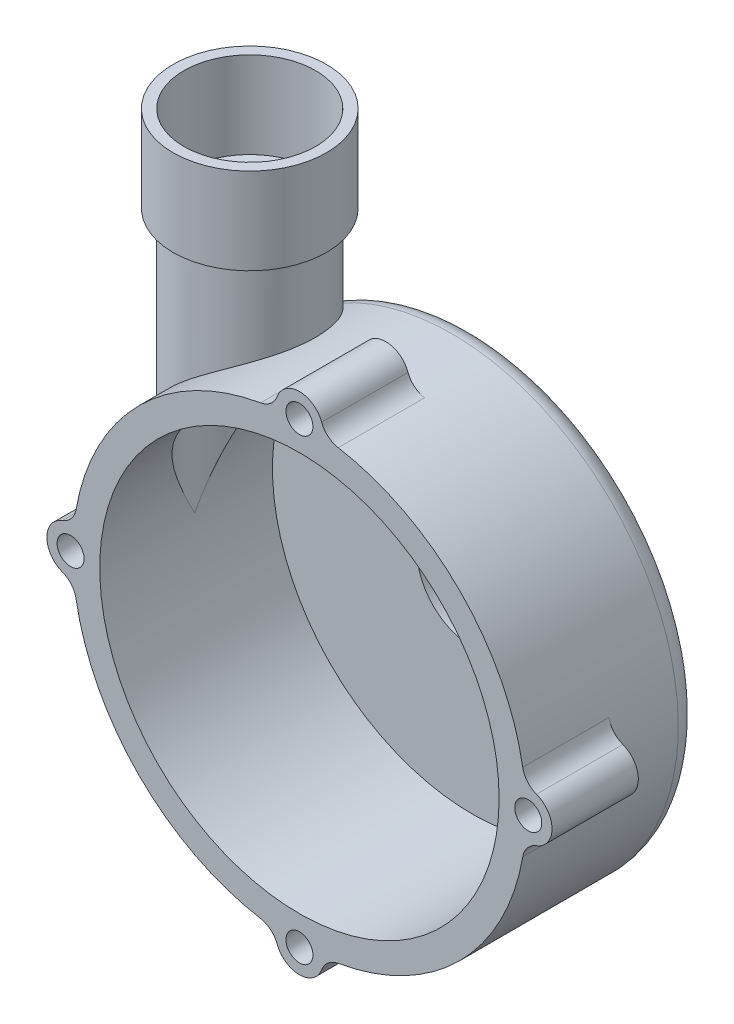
ISO-10303-21;
HEADER;
FILE_DESCRIPTION(('STEP AP214'),'2;1');
FILE_NAME('part.step','',(''),(''),'','','');
FILE_SCHEMA(('AUTOMOTIVE_DESIGN { 1 0 10303 214 1 1 1 1 }'));
ENDSEC;
DATA;
#1=APPLICATION_CONTEXT('core data for automotive mechanical design processes');
#2=APPLICATION_PROTOCOL_DEFINITION('international standard','automotive_design',2000,#1);
#3=PRODUCT_CONTEXT('',#1,'mechanical');
#4=PRODUCT('Part','Part','',(#3));
#5=PRODUCT_RELATED_PRODUCT_CATEGORY('part','',(#4));
#6=PRODUCT_DEFINITION_FORMATION('','',#4);
#7=PRODUCT_DEFINITION_CONTEXT('part definition',#1,'design');
#8=PRODUCT_DEFINITION('design','',#6,#7);
#9=PRODUCT_DEFINITION_SHAPE('','',#8);
#10=(LENGTH_UNIT() NAMED_UNIT(*) SI_UNIT(.MILLI.,.METRE.));
#11=(NAMED_UNIT(*) PLANE_ANGLE_UNIT() SI_UNIT($,.RADIAN.));
#12=(NAMED_UNIT(*) SI_UNIT($,.STERADIAN.) SOLID_ANGLE_UNIT());
#13=UNCERTAINTY_MEASURE_WITH_UNIT(LENGTH_MEASURE(1.E-05),#10,'distance_accuracy_value','');
#14=(GEOMETRIC_REPRESENTATION_CONTEXT(3) GLOBAL_UNCERTAINTY_ASSIGNED_CONTEXT((#13)) GLOBAL_UNIT_ASSIGNED_CONTEXT((#10,
#11,#12)) REPRESENTATION_CONTEXT('',''));
#15=CARTESIAN_POINT('',(0.,0.,0.));
#16=DIRECTION('',(0.,0.,1.));
#17=DIRECTION('',(1.,0.,0.));
#18=AXIS2_PLACEMENT_3D('',#15,#16,#17);
#19=CARTESIAN_POINT('',(-67.,175.,38.));
#20=DIRECTION('',(0.,1.,0.));
#21=DIRECTION('',(0.,0.,1.));
#22=AXIS2_PLACEMENT_3D('',#19,#20,#21);
#23=PLANE('',#22);
#24=CARTESIAN_POINT('',(-67.,175.,38.));
#25=DIRECTION('',(0.,1.,0.));
#26=DIRECTION('',(0.,0.,1.));
#27=AXIS2_PLACEMENT_3D('',#24,#25,#26);
#28=CIRCLE('',#27,35.5);
#29=CARTESIAN_POINT('',(-67.,175.,73.5));
#30=VERTEX_POINT('',#29);
#31=EDGE_CURVE('E11',#30,#30,#28,.T.);
#32=ORIENTED_EDGE('',*,*,#31,.T.);
#33=EDGE_LOOP('',(#32));
#34=FACE_BOUND('',#33,.T.);
#35=CARTESIAN_POINT('',(-67.,175.,38.));
#36=DIRECTION('',(0.,1.,0.));
#37=DIRECTION('',(0.,0.,1.));
#38=AXIS2_PLACEMENT_3D('',#35,#36,#37);
#39=CIRCLE('',#38,30.5);
#40=CARTESIAN_POINT('',(-67.,175.,68.5));
#41=VERTEX_POINT('',#40);
#42=EDGE_CURVE('E51',#41,#41,#39,.T.);
#43=ORIENTED_EDGE('',*,*,#42,.F.);
#44=EDGE_LOOP('',(#43));
#45=FACE_BOUND('',#44,.T.);
#46=ADVANCED_FACE('F40',(#34,#45),#23,.T.);
#47=CARTESIAN_POINT('',(-67.,135.,38.));
#48=DIRECTION('',(0.,1.,0.));
#49=DIRECTION('',(0.,0.,1.));
#50=AXIS2_PLACEMENT_3D('',#47,#48,#49);
#51=PLANE('',#50);
#52=CARTESIAN_POINT('',(-67.,135.,38.));
#53=DIRECTION('',(0.,1.,0.));
#54=DIRECTION('',(0.,0.,1.));
#55=AXIS2_PLACEMENT_3D('',#52,#53,#54);
#56=CIRCLE('',#55,35.5);
#57=CARTESIAN_POINT('',(-67.,135.,73.5));
#58=VERTEX_POINT('',#57);
#59=EDGE_CURVE('E44',#58,#58,#56,.T.);
#60=ORIENTED_EDGE('',*,*,#59,.F.);
#61=EDGE_LOOP('',(#60));
#62=FACE_BOUND('',#61,.T.);
#63=CARTESIAN_POINT('',(-67.,135.,38.));
#64=DIRECTION('',(0.,1.,0.));
#65=DIRECTION('',(0.,0.,1.));
#66=AXIS2_PLACEMENT_3D('',#63,#64,#65);
#67=CIRCLE('',#66,30.5);
#68=CARTESIAN_POINT('',(-67.,135.,68.5));
#69=VERTEX_POINT('',#68);
#70=EDGE_CURVE('E53',#69,#69,#67,.T.);
#71=ORIENTED_EDGE('',*,*,#70,.T.);
#72=EDGE_LOOP('',(#71));
#73=FACE_BOUND('',#72,.T.);
#74=ADVANCED_FACE('F63',(#62,#73),#51,.F.);
#75=CARTESIAN_POINT('',(-67.,175.,38.));
#76=DIRECTION('',(0.,-1.,0.));
#77=DIRECTION('',(0.,0.,-1.));
#78=AXIS2_PLACEMENT_3D('',#75,#76,#77);
#79=CYLINDRICAL_SURFACE('',#78,35.5);
#80=ORIENTED_EDGE('',*,*,#31,.F.);
#81=EDGE_LOOP('',(#80));
#82=FACE_BOUND('',#81,.T.);
#83=ORIENTED_EDGE('',*,*,#59,.T.);
#84=EDGE_LOOP('',(#83));
#85=FACE_BOUND('',#84,.T.);
#86=ADVANCED_FACE('F42',(#82,#85),#79,.T.);
#87=CARTESIAN_POINT('',(-67.,175.,38.));
#88=DIRECTION('',(0.,-1.,0.));
#89=DIRECTION('',(0.,0.,-1.));
#90=AXIS2_PLACEMENT_3D('',#87,#88,#89);
#91=CYLINDRICAL_SURFACE('',#90,30.5);
#92=ORIENTED_EDGE('',*,*,#42,.T.);
#93=EDGE_LOOP('',(#92));
#94=FACE_BOUND('',#93,.T.);
#95=ORIENTED_EDGE('',*,*,#70,.F.);
#96=EDGE_LOOP('',(#95));
#97=FACE_BOUND('',#96,.T.);
#98=ADVANCED_FACE('F59',(#94,#97),#91,.F.);
#99=CLOSED_SHELL('',(#46,#74,#86,#98));
#100=MANIFOLD_SOLID_BREP('B2',#99);
#101=CARTESIAN_POINT('',(0.,0.,82.));
#102=DIRECTION('',(0.,0.,-1.));
#103=DIRECTION('',(-1.,0.,0.));
#104=AXIS2_PLACEMENT_3D('',#101,#102,#103);
#105=CYLINDRICAL_SURFACE('',#104,105.);
#106=CARTESIAN_POINT('',(-67.,80.8455317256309,7.5));
#107=CARTESIAN_POINT('',(-67.991903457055,80.0234909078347,7.50000074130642));
#108=CARTESIAN_POINT('',(-68.9687996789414,79.1830471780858,7.54838207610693));
#109=CARTESIAN_POINT('',(-70.8864600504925,77.4710505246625,7.7332851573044));
#110=CARTESIAN_POINT('',(-71.8272115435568,76.5994869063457,7.86983748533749));
#111=CARTESIAN_POINT('',(-73.6707064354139,74.8282380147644,8.22358618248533));
#112=CARTESIAN_POINT('',(-74.5733453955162,73.928485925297,8.44098992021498));
#113=CARTESIAN_POINT('',(-76.3353235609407,72.1077206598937,8.94931025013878));
#114=CARTESIAN_POINT('',(-77.1946627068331,71.1867074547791,9.24022694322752));
#115=CARTESIAN_POINT('',(-78.6317280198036,69.5906362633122,9.79774117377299));
#116=CARTESIAN_POINT('',(-79.2204081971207,68.9196268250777,10.047977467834));
#117=CARTESIAN_POINT('',(-80.3742906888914,67.5704170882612,10.5813498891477));
#118=CARTESIAN_POINT('',(-80.9394911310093,66.8922162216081,10.864488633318));
#119=CARTESIAN_POINT('',(-82.0463392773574,65.5299083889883,11.462225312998));
#120=CARTESIAN_POINT('',(-82.587975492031,64.8457987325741,11.7768383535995));
#121=CARTESIAN_POINT('',(-83.6472282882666,63.4735568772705,12.4361783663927));
#122=CARTESIAN_POINT('',(-84.1648455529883,62.7854247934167,12.7809044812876));
#123=CARTESIAN_POINT('',(-85.17554602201,61.4072955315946,13.4993135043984));
#124=CARTESIAN_POINT('',(-85.6686489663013,60.7173003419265,13.8729724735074));
#125=CARTESIAN_POINT('',(-86.6306958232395,59.3365866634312,14.6490306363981));
#126=CARTESIAN_POINT('',(-87.0996388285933,58.645868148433,15.0514309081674));
#127=CARTESIAN_POINT('',(-88.0129801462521,57.2660409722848,15.884697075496));
#128=CARTESIAN_POINT('',(-88.4573915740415,56.5769316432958,16.3155474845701));
#129=CARTESIAN_POINT('',(-89.321709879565,55.2022752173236,17.2063372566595));
#130=CARTESIAN_POINT('',(-89.7416194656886,54.5167277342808,17.6662733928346));
#131=CARTESIAN_POINT('',(-90.5552292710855,53.1542820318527,18.6146908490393));
#132=CARTESIAN_POINT('',(-90.9490172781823,52.4773617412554,19.1030649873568));
#133=CARTESIAN_POINT('',(-91.7114807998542,51.1331707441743,20.1116672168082));
#134=CARTESIAN_POINT('',(-92.0801575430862,50.465899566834,20.6318937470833));
#135=CARTESIAN_POINT('',(-92.7915797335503,49.1455493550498,21.707055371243));
#136=CARTESIAN_POINT('',(-93.1343249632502,48.4924704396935,22.2619907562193));
#137=CARTESIAN_POINT('',(-93.792482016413,47.2068964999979,23.4105777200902));
#138=CARTESIAN_POINT('',(-94.107899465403,46.5743972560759,24.0042212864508));
#139=CARTESIAN_POINT('',(-94.6292322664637,45.5034402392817,25.072186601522));
#140=CARTESIAN_POINT('',(-94.8419650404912,45.0581021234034,25.5362695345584));
#141=CARTESIAN_POINT('',(-95.2501973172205,44.1885774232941,26.4914689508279));
#142=CARTESIAN_POINT('',(-95.4456930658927,43.7643954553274,26.9825912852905));
#143=CARTESIAN_POINT('',(-95.8170410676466,42.9452725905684,27.9941054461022));
#144=CARTESIAN_POINT('',(-95.9929318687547,42.5502748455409,28.5144366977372));
#145=CARTESIAN_POINT('',(-96.3226023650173,41.7986154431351,29.5886790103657));
#146=CARTESIAN_POINT('',(-96.476398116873,41.4419259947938,30.1425652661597));
#147=CARTESIAN_POINT('',(-96.6966890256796,40.9242219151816,31.0381395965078));
#148=CARTESIAN_POINT('',(-96.7720801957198,40.7455284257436,31.3674538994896));
#149=CARTESIAN_POINT('',(-96.9135935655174,40.4077819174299,32.0380890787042));
#150=CARTESIAN_POINT('',(-96.9797144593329,40.2487316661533,32.3794116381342));
#151=CARTESIAN_POINT('',(-97.101550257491,39.9539034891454,33.0734735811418));
#152=CARTESIAN_POINT('',(-97.1572744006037,39.8181049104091,33.426202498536));
#153=CARTESIAN_POINT('',(-97.2572131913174,39.5733745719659,34.1423273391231));
#154=CARTESIAN_POINT('',(-97.3014338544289,39.4644287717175,34.5057175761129));
#155=CARTESIAN_POINT('',(-97.3778093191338,39.275600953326,35.2469250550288));
#156=CARTESIAN_POINT('',(-97.4097817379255,39.1961587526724,35.6248745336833));
#157=CARTESIAN_POINT('',(-97.4597327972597,39.0717932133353,36.3873691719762));
#158=CARTESIAN_POINT('',(-97.4777123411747,39.026867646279,36.7719139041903));
#159=CARTESIAN_POINT('',(-97.4990260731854,38.9735905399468,37.5436358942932));
#160=CARTESIAN_POINT('',(-97.5023725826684,38.9652082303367,37.9308106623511));
#161=CARTESIAN_POINT('',(-97.4943239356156,38.9853424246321,38.7040230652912));
#162=CARTESIAN_POINT('',(-97.4829298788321,39.0138561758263,39.0900607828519));
#163=CARTESIAN_POINT('',(-97.4486799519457,39.0993154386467,39.7982498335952));
#164=CARTESIAN_POINT('',(-97.4278484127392,39.1512335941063,40.1211246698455));
#165=CARTESIAN_POINT('',(-97.3764337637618,39.2789369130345,40.7614227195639));
#166=CARTESIAN_POINT('',(-97.3458472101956,39.3547305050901,41.078843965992));
#167=CARTESIAN_POINT('',(-97.2755655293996,39.5281301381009,41.7067523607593));
#168=CARTESIAN_POINT('',(-97.2358662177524,39.6257461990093,42.0172362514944));
#169=CARTESIAN_POINT('',(-97.1480855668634,39.8404685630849,42.6302123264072));
#170=CARTESIAN_POINT('',(-97.1000016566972,39.9575808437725,42.932702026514));
#171=CARTESIAN_POINT('',(-96.9618241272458,40.2921278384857,43.7264331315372));
#172=CARTESIAN_POINT('',(-96.8649822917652,40.5246782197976,44.2101643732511));
#173=CARTESIAN_POINT('',(-96.6531699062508,41.0272976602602,45.153576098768));
#174=CARTESIAN_POINT('',(-96.5381872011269,41.2973918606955,45.6132401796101));
#175=CARTESIAN_POINT('',(-96.2922145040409,41.8677220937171,46.5107741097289));
#176=CARTESIAN_POINT('',(-96.1611791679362,42.1680430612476,46.948577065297));
#177=CARTESIAN_POINT('',(-95.885281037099,42.7916951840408,47.8026484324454));
#178=CARTESIAN_POINT('',(-95.74042029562,43.1150229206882,48.2189200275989));
#179=CARTESIAN_POINT('',(-95.4358003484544,43.7852227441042,49.0385455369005));
#180=CARTESIAN_POINT('',(-95.2758367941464,44.1323926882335,49.4415783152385));
#181=CARTESIAN_POINT('',(-94.9441249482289,44.8415706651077,50.2294145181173));
#182=CARTESIAN_POINT('',(-94.7723740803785,45.203581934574,50.6142139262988));
#183=CARTESIAN_POINT('',(-94.417776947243,45.9396391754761,51.3674571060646));
#184=CARTESIAN_POINT('',(-94.2349215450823,46.3136949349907,51.735886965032));
#185=CARTESIAN_POINT('',(-93.8588557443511,47.0711590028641,52.4574324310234));
#186=CARTESIAN_POINT('',(-93.6656460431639,47.4545666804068,52.8105490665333));
#187=CARTESIAN_POINT('',(-93.268813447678,48.2298513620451,53.5035235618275));
#188=CARTESIAN_POINT('',(-93.0651659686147,48.6217469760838,53.8433464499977));
#189=CARTESIAN_POINT('',(-92.6482316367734,49.4115838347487,54.5097756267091));
#190=CARTESIAN_POINT('',(-92.4349447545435,49.8095250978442,54.836381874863));
#191=CARTESIAN_POINT('',(-91.9990520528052,50.6100985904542,55.4770552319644));
#192=CARTESIAN_POINT('',(-91.776449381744,51.0127292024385,55.7911265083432));
#193=CARTESIAN_POINT('',(-91.3220381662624,51.8218168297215,56.4074718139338));
#194=CARTESIAN_POINT('',(-91.0902292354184,52.2282740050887,56.7097453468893));
#195=CARTESIAN_POINT('',(-90.4524115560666,53.3291881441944,57.5102455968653));
#196=CARTESIAN_POINT('',(-90.0378456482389,54.0264617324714,57.9978334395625));
#197=CARTESIAN_POINT('',(-89.1829910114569,55.4262299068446,58.9420729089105));
#198=CARTESIAN_POINT('',(-88.7426995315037,56.1287250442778,59.3987212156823));
#199=CARTESIAN_POINT('',(-87.8364106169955,57.5366516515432,60.2821599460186));
#200=CARTESIAN_POINT('',(-87.3703982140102,58.2420846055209,60.7089326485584));
#201=CARTESIAN_POINT('',(-86.4130851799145,59.6532117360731,61.532547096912));
#202=CARTESIAN_POINT('',(-85.9217854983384,60.3589059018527,61.9293899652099));
#203=CARTESIAN_POINT('',(-84.9144795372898,61.7679566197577,62.692514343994));
#204=CARTESIAN_POINT('',(-84.3984977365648,62.471314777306,63.0588251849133));
#205=CARTESIAN_POINT('',(-83.3414842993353,63.8746326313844,63.7605964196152));
#206=CARTESIAN_POINT('',(-82.8004520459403,64.5745922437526,64.0960560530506));
#207=CARTESIAN_POINT('',(-81.693739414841,65.9691206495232,64.7348467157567));
#208=CARTESIAN_POINT('',(-81.128070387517,66.6636917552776,65.0381923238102));
#209=CARTESIAN_POINT('',(-79.9721605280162,68.0460539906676,65.6113958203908));
#210=CARTESIAN_POINT('',(-79.3819213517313,68.7338455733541,65.8812559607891));
#211=CARTESIAN_POINT('',(-77.8740227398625,70.4450950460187,66.512619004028));
#212=CARTESIAN_POINT('',(-76.9410080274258,71.4633739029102,66.8519403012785));
#213=CARTESIAN_POINT('',(-75.0220884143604,73.475293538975,67.4432324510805));
#214=CARTESIAN_POINT('',(-74.0361837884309,74.4689344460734,67.6952037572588));
#215=CARTESIAN_POINT('',(-72.0162640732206,76.424015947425,68.1022753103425));
#216=CARTESIAN_POINT('',(-70.9823202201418,77.3855007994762,68.2575143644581));
#217=CARTESIAN_POINT('',(-68.8704726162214,79.2707992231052,68.4610562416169));
#218=CARTESIAN_POINT('',(-67.7925805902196,80.1946227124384,68.5093873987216));
#219=CARTESIAN_POINT('',(-65.8497007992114,81.7925485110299,68.490070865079));
#220=CARTESIAN_POINT('',(-64.9919172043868,82.4757395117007,68.4462567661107));
#221=CARTESIAN_POINT('',(-63.2598837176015,83.8115888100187,68.2823049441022));
#222=CARTESIAN_POINT('',(-62.3856350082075,84.4642492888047,68.1621726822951));
#223=CARTESIAN_POINT('',(-60.627835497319,85.7347109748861,67.8402953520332));
#224=CARTESIAN_POINT('',(-59.744292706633,86.3525396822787,67.6386157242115));
#225=CARTESIAN_POINT('',(-57.9752695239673,87.550032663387,67.1486902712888));
#226=CARTESIAN_POINT('',(-57.0897894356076,88.1297025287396,66.8604571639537));
#227=CARTESIAN_POINT('',(-55.4648457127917,89.1595544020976,66.245743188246));
#228=CARTESIAN_POINT('',(-54.7242567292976,89.6157884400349,65.9323455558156));
#229=CARTESIAN_POINT('',(-53.2551763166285,90.4965155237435,65.2394778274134));
#230=CARTESIAN_POINT('',(-52.5266837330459,90.9210116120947,64.860014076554));
#231=CARTESIAN_POINT('',(-51.0891680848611,91.7364690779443,64.0342534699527));
#232=CARTESIAN_POINT('',(-50.3801418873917,92.1274358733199,63.5879674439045));
#233=CARTESIAN_POINT('',(-48.9892203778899,92.8745366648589,62.6287521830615));
#234=CARTESIAN_POINT('',(-48.3073255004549,93.2306701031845,62.1158218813));
#235=CARTESIAN_POINT('',(-46.9754390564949,93.9088361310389,61.0220153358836));
#236=CARTESIAN_POINT('',(-46.32562450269,94.2306888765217,60.4408114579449));
#237=CARTESIAN_POINT('',(-45.0698118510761,94.8377490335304,59.2152437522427));
#238=CARTESIAN_POINT('',(-44.4638145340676,95.122955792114,58.5708787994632));
#239=CARTESIAN_POINT('',(-43.3037125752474,95.6566583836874,57.2230711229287));
#240=CARTESIAN_POINT('',(-42.7496008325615,95.9051592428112,56.5196365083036));
#241=CARTESIAN_POINT('',(-41.7006626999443,96.3658811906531,55.0587785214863));
#242=CARTESIAN_POINT('',(-41.2058311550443,96.5781054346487,54.3013598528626));
#243=CARTESIAN_POINT('',(-40.3242877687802,96.9492615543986,52.8100269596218));
#244=CARTESIAN_POINT('',(-39.9318310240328,97.1112886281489,52.0802696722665));
#245=CARTESIAN_POINT('',(-39.205766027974,97.4066815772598,50.5865025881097));
#246=CARTESIAN_POINT('',(-38.8721540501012,97.5400492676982,49.8224949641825));
#247=CARTESIAN_POINT('',(-38.2675296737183,97.7788417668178,48.2660639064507));
#248=CARTESIAN_POINT('',(-37.9965044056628,97.8842723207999,47.4736463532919));
#249=CARTESIAN_POINT('',(-37.5199348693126,98.0679346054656,45.8662822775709));
#250=CARTESIAN_POINT('',(-37.3143898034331,98.1461666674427,45.0513360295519));
#251=CARTESIAN_POINT('',(-36.9776450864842,98.2735207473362,43.4370566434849));
#252=CARTESIAN_POINT('',(-36.8438796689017,98.3236507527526,42.6383369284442));
#253=CARTESIAN_POINT('',(-36.6402462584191,98.399716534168,41.0316686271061));
#254=CARTESIAN_POINT('',(-36.5703762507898,98.4256530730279,40.2237203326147));
#255=CARTESIAN_POINT('',(-36.4952219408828,98.4535443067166,38.6044727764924));
#256=CARTESIAN_POINT('',(-36.4899330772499,98.4555006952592,37.7931737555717));
#257=CARTESIAN_POINT('',(-36.5439808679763,98.4354524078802,36.1730241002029));
#258=CARTESIAN_POINT('',(-36.6033176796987,98.4134476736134,35.3641734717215));
#259=CARTESIAN_POINT('',(-36.7853201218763,98.3455618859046,33.7610311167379));
#260=CARTESIAN_POINT('',(-36.9074896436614,98.2998678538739,32.9666750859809));
#261=CARTESIAN_POINT('',(-37.2136818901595,98.1843603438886,31.3917656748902));
#262=CARTESIAN_POINT('',(-37.3977040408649,98.114547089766,30.6112121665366));
#263=CARTESIAN_POINT('',(-37.825779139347,97.9503084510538,29.0694413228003));
#264=CARTESIAN_POINT('',(-38.0698290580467,97.8558843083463,28.3082230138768));
#265=CARTESIAN_POINT('',(-38.6155365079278,97.6418259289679,26.8103814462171));
#266=CARTESIAN_POINT('',(-38.9171942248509,97.5221916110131,26.0737582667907));
#267=CARTESIAN_POINT('',(-39.5760307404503,97.2566923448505,24.6280613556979));
#268=CARTESIAN_POINT('',(-39.9333667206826,97.1107529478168,23.9190729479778));
#269=CARTESIAN_POINT('',(-40.6992805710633,96.792254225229,22.5356116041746));
#270=CARTESIAN_POINT('',(-41.1078582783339,96.6196949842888,21.8611385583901));
#271=CARTESIAN_POINT('',(-41.9720466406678,96.2474338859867,20.5510077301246));
#272=CARTESIAN_POINT('',(-42.4276544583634,96.0477336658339,19.9153476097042));
#273=CARTESIAN_POINT('',(-43.3812723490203,95.6208033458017,18.6865178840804));
#274=CARTESIAN_POINT('',(-43.8792829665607,95.3935728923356,18.09334882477));
#275=CARTESIAN_POINT('',(-44.9230685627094,94.9065650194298,16.9411435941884));
#276=CARTESIAN_POINT('',(-45.4696021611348,94.6462254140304,16.3830326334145));
#277=CARTESIAN_POINT('',(-46.5959519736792,94.0968108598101,15.3168291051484));
#278=CARTESIAN_POINT('',(-47.1757684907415,93.8077356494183,14.8087369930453));
#279=CARTESIAN_POINT('',(-48.3630416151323,93.2011832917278,13.8442792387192));
#280=CARTESIAN_POINT('',(-48.9705026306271,92.8837016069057,13.3879218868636));
#281=CARTESIAN_POINT('',(-50.2072681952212,92.2210519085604,12.5280252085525));
#282=CARTESIAN_POINT('',(-50.8365733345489,91.8758831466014,12.1244873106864));
#283=CARTESIAN_POINT('',(-52.1524622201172,91.1357578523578,11.3462604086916));
#284=CARTESIAN_POINT('',(-52.8401284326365,90.7390273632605,10.9750903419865));
#285=CARTESIAN_POINT('',(-54.2276420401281,89.9167019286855,10.2923324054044));
#286=CARTESIAN_POINT('',(-54.9274901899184,89.4911051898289,9.9807482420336));
#287=CARTESIAN_POINT('',(-56.3335847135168,88.6127218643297,9.41588361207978));
#288=CARTESIAN_POINT('',(-57.0398313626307,88.1599341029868,9.16260566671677));
#289=CARTESIAN_POINT('',(-58.4535042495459,87.2290319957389,8.71249972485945));
#290=CARTESIAN_POINT('',(-59.1609304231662,86.7509189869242,8.51566875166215));
#291=CARTESIAN_POINT('',(-60.4721784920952,85.8408943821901,8.20024364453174));
#292=CARTESIAN_POINT('',(-61.0764444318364,85.4120658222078,8.074508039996));
#293=CARTESIAN_POINT('',(-62.2800421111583,84.5384482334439,7.8612295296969));
#294=CARTESIAN_POINT('',(-62.879374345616,84.0936608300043,7.77368274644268));
#295=CARTESIAN_POINT('',(-64.0708113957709,83.1894833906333,7.6350627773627));
#296=CARTESIAN_POINT('',(-64.6629188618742,82.7300989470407,7.58397579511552));
#297=CARTESIAN_POINT('',(-65.8383851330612,81.7977395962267,7.51644188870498));
#298=CARTESIAN_POINT('',(-66.4217427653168,81.3247628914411,7.49999956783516));
#299=CARTESIAN_POINT('',(-67.,80.8455317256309,7.5));
#300=B_SPLINE_CURVE_WITH_KNOTS('',3,(#106,#107,#108,#109,#110,#111,#112,#113,#114,#115,#116,
#117,#118,#119,#120,#121,#122,#123,#124,#125,#126,#127,#128,#129,#130,#131,#132,#133,#134,#135,
#136,#137,#138,#139,#140,#141,#142,#143,#144,#145,#146,#147,#148,#149,#150,#151,#152,#153,#154,
#155,#156,#157,#158,#159,#160,#161,#162,#163,#164,#165,#166,#167,#168,#169,#170,#171,#172,#173,
#174,#175,#176,#177,#178,#179,#180,#181,#182,#183,#184,#185,#186,#187,#188,#189,#190,#191,#192,
#193,#194,#195,#196,#197,#198,#199,#200,#201,#202,#203,#204,#205,#206,#207,#208,#209,#210,#211,
#212,#213,#214,#215,#216,#217,#218,#219,#220,#221,#222,#223,#224,#225,#226,#227,#228,#229,#230,
#231,#232,#233,#234,#235,#236,#237,#238,#239,#240,#241,#242,#243,#244,#245,#246,#247,#248,#249,
#250,#251,#252,#253,#254,#255,#256,#257,#258,#259,#260,#261,#262,#263,#264,#265,#266,#267,#268,
#269,#270,#271,#272,#273,#274,#275,#276,#277,#278,#279,#280,#281,#282,#283,#284,#285,#286,#287,
#288,#289,#290,#291,#292,#293,#294,#295,#296,#297,#298,#299),.UNSPECIFIED.,.T.,.F.,(4,2,2,2,2,2,
2,2,2,2,2,2,2,2,2,2,2,2,2,2,2,2,2,2,2,2,2,2,2,2,2,2,2,2,2,2,2,2,2,2,2,2,2,2,2,2,2,2,2,2,2,2,2,2,
2,2,2,2,2,2,2,2,2,2,2,2,2,2,2,2,2,2,2,2,2,2,2,2,2,2,2,2,2,2,2,2,2,2,2,2,2,2,2,2,2,2,4),(0.,
3.86417911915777,7.72969922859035,11.6052028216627,15.4807117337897,18.2609900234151,
21.0414895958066,23.8233300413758,26.6050913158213,29.3845750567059,32.164163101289,
34.9422503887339,37.7200300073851,40.4879441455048,43.2557227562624,46.023524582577,
48.7907552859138,50.8222608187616,52.8542077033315,54.8820860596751,56.9084831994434,
58.0543689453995,59.2004159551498,60.3454396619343,61.489863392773,62.6507209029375,
63.8115034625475,64.9713084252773,66.1310268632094,67.1130019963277,68.0953241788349,
69.0780983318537,70.0611743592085,71.6945797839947,73.3290843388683,74.9683172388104,
76.6073070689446,78.2730110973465,79.9390803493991,81.6065395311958,83.2738865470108,
84.9453594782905,86.616837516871,88.2877551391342,89.9587429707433,92.7971537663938,
95.6358686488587,98.4762533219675,101.316531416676,104.154048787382,106.991636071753,
109.827929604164,112.664032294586,116.926708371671,121.189362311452,125.445885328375,
129.70128009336,132.990842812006,136.280170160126,139.566863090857,142.853073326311,
145.624020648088,148.394701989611,151.164934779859,153.935211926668,156.719372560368,
159.50358279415,162.287411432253,165.070997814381,167.600702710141,170.130247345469,
172.659271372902,175.188264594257,177.619539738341,180.050738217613,182.481764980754,
184.912797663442,187.324923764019,189.737027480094,192.149009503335,194.560999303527,
196.979925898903,199.398844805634,201.817617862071,204.236421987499,206.70382293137,
209.171246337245,211.639064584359,214.106949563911,216.733382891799,219.359979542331,
221.986689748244,224.613261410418,226.86677295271,229.120055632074,231.372485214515,
233.625214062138),.UNSPECIFIED.);
#301=CARTESIAN_POINT('',(-82.0996688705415,65.4571949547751,11.5));
#302=VERTEX_POINT('',#301);
#303=CARTESIAN_POINT('',(-51.9003311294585,91.2762599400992,11.5));
#304=VERTEX_POINT('',#303);
#305=EDGE_CURVE('E253',#302,#304,#300,.T.);
#306=ORIENTED_EDGE('',*,*,#305,.F.);
#307=CARTESIAN_POINT('',(0.,0.,11.5));
#308=DIRECTION('',(0.,0.,-1.));
#309=DIRECTION('',(-1.,0.,0.));
#310=AXIS2_PLACEMENT_3D('',#307,#308,#309);
#311=CIRCLE('',#310,105.);
#312=EDGE_CURVE('E244',#302,#304,#311,.F.);
#313=ORIENTED_EDGE('',*,*,#312,.T.);
#314=EDGE_LOOP('',(#306,#313));
#315=FACE_BOUND('',#314,.T.);
#316=CARTESIAN_POINT('',(0.,0.,82.));
#317=DIRECTION('',(0.,0.,1.));
#318=DIRECTION('',(1.,0.,0.));
#319=AXIS2_PLACEMENT_3D('',#316,#317,#318);
#320=CIRCLE('',#319,105.);
#321=CARTESIAN_POINT('',(103.4495488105,17.9775095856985,82.));
#322=VERTEX_POINT('',#321);
#323=CARTESIAN_POINT('',(17.9775095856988,103.4495488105,82.));
#324=VERTEX_POINT('',#323);
#325=EDGE_CURVE('E429',#322,#324,#320,.T.);
#326=ORIENTED_EDGE('',*,*,#325,.F.);
#327=DIRECTION('',(0.,0.,-1.));
#328=VECTOR('',#327,1.);
#329=CARTESIAN_POINT('',(103.4495488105,17.9775095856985,82.));
#330=LINE('',#329,#328);
#331=CARTESIAN_POINT('',(103.4495488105,17.9775095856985,42.));
#332=VERTEX_POINT('',#331);
#333=EDGE_CURVE('E469',#322,#332,#330,.T.);
#334=ORIENTED_EDGE('',*,*,#333,.T.);
#335=CARTESIAN_POINT('',(0.,0.,42.));
#336=DIRECTION('',(0.,0.,1.));
#337=DIRECTION('',(1.,0.,0.));
#338=AXIS2_PLACEMENT_3D('',#335,#336,#337);
#339=CIRCLE('',#338,105.);
#340=CARTESIAN_POINT('',(103.4495488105,-17.9775095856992,42.));
#341=VERTEX_POINT('',#340);
#342=EDGE_CURVE('E541',#341,#332,#339,.T.);
#343=ORIENTED_EDGE('',*,*,#342,.F.);
#344=DIRECTION('',(0.,0.,-1.));
#345=VECTOR('',#344,1.);
#346=CARTESIAN_POINT('',(103.4495488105,-17.9775095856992,82.));
#347=LINE('',#346,#345);
#348=CARTESIAN_POINT('',(103.4495488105,-17.9775095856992,82.));
#349=VERTEX_POINT('',#348);
#350=EDGE_CURVE('E466',#341,#349,#347,.F.);
#351=ORIENTED_EDGE('',*,*,#350,.T.);
#352=CARTESIAN_POINT('',(17.9775095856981,-103.449548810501,82.));
#353=VERTEX_POINT('',#352);
#354=EDGE_CURVE('E433',#353,#349,#320,.T.);
#355=ORIENTED_EDGE('',*,*,#354,.F.);
#356=DIRECTION('',(0.,0.,-1.));
#357=VECTOR('',#356,1.);
#358=CARTESIAN_POINT('',(17.9775095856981,-103.449548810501,82.));
#359=LINE('',#358,#357);
#360=CARTESIAN_POINT('',(17.9775095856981,-103.449548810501,42.));
#361=VERTEX_POINT('',#360);
#362=EDGE_CURVE('E457',#353,#361,#359,.T.);
#363=ORIENTED_EDGE('',*,*,#362,.T.);
#364=CARTESIAN_POINT('',(0.,0.,42.));
#365=DIRECTION('',(0.,0.,1.));
#366=DIRECTION('',(1.,0.,0.));
#367=AXIS2_PLACEMENT_3D('',#364,#365,#366);
#368=CIRCLE('',#367,105.);
#369=CARTESIAN_POINT('',(-17.9775095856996,-103.4495488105,42.));
#370=VERTEX_POINT('',#369);
#371=EDGE_CURVE('E539',#370,#361,#368,.T.);
#372=ORIENTED_EDGE('',*,*,#371,.F.);
#373=DIRECTION('',(0.,0.,-1.));
#374=VECTOR('',#373,1.);
#375=CARTESIAN_POINT('',(-17.9775095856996,-103.4495488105,82.));
#376=LINE('',#375,#374);
#377=CARTESIAN_POINT('',(-17.9775095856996,-103.4495488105,82.));
#378=VERTEX_POINT('',#377);
#379=EDGE_CURVE('E451',#370,#378,#376,.F.);
#380=ORIENTED_EDGE('',*,*,#379,.T.);
#381=CARTESIAN_POINT('',(-103.449548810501,-17.9775095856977,82.));
#382=VERTEX_POINT('',#381);
#383=EDGE_CURVE('E266',#382,#378,#320,.T.);
#384=ORIENTED_EDGE('',*,*,#383,.F.);
#385=DIRECTION('',(0.,0.,-1.));
#386=VECTOR('',#385,1.);
#387=CARTESIAN_POINT('',(-103.449548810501,-17.9775095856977,82.));
#388=LINE('',#387,#386);
#389=CARTESIAN_POINT('',(-103.449548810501,-17.9775095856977,42.));
#390=VERTEX_POINT('',#389);
#391=EDGE_CURVE('E449',#382,#390,#388,.T.);
#392=ORIENTED_EDGE('',*,*,#391,.T.);
#393=CARTESIAN_POINT('',(0.,0.,42.));
#394=DIRECTION('',(0.,0.,1.));
#395=DIRECTION('',(1.,0.,0.));
#396=AXIS2_PLACEMENT_3D('',#393,#394,#395);
#397=CIRCLE('',#396,105.);
#398=CARTESIAN_POINT('',(-103.4495488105,17.9775095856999,42.));
#399=VERTEX_POINT('',#398);
#400=EDGE_CURVE('E249',#399,#390,#397,.T.);
#401=ORIENTED_EDGE('',*,*,#400,.F.);
#402=DIRECTION('',(0.,0.,-1.));
#403=VECTOR('',#402,1.);
#404=CARTESIAN_POINT('',(-103.4495488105,17.9775095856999,82.));
#405=LINE('',#404,#403);
#406=CARTESIAN_POINT('',(-103.4495488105,17.9775095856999,82.));
#407=VERTEX_POINT('',#406);
#408=EDGE_CURVE('E460',#399,#407,#405,.F.);
#409=ORIENTED_EDGE('',*,*,#408,.T.);
#410=CARTESIAN_POINT('',(-17.9775095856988,103.4495488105,82.));
#411=VERTEX_POINT('',#410);
#412=EDGE_CURVE('E254',#411,#407,#320,.T.);
#413=ORIENTED_EDGE('',*,*,#412,.F.);
#414=DIRECTION('',(0.,0.,-1.));
#415=VECTOR('',#414,1.);
#416=CARTESIAN_POINT('',(-17.9775095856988,103.4495488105,82.));
#417=LINE('',#416,#415);
#418=CARTESIAN_POINT('',(-17.9775095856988,103.4495488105,42.));
#419=VERTEX_POINT('',#418);
#420=EDGE_CURVE('E455',#411,#419,#417,.T.);
#421=ORIENTED_EDGE('',*,*,#420,.T.);
#422=CARTESIAN_POINT('',(0.,0.,42.));
#423=DIRECTION('',(0.,0.,1.));
#424=DIRECTION('',(1.,0.,0.));
#425=AXIS2_PLACEMENT_3D('',#422,#423,#424);
#426=CIRCLE('',#425,105.);
#427=CARTESIAN_POINT('',(17.9775095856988,103.4495488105,42.));
#428=VERTEX_POINT('',#427);
#429=EDGE_CURVE('E524',#428,#419,#426,.T.);
#430=ORIENTED_EDGE('',*,*,#429,.F.);
#431=DIRECTION('',(0.,0.,-1.));
#432=VECTOR('',#431,1.);
#433=CARTESIAN_POINT('',(17.9775095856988,103.4495488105,82.));
#434=LINE('',#433,#432);
#435=EDGE_CURVE('E521',#428,#324,#434,.F.);
#436=ORIENTED_EDGE('',*,*,#435,.T.);
#437=EDGE_LOOP('',(#326,#334,#343,#351,#355,#363,#372,#380,#384,#392,#401,#409,#413,#421,#430,#436));
#438=FACE_BOUND('',#437,.T.);
#439=ADVANCED_FACE('F101',(#315,#438),#105,.T.);
#440=CARTESIAN_POINT('',(0.,0.,82.));
#441=DIRECTION('',(0.,0.,1.));
#442=DIRECTION('',(1.,0.,0.));
#443=AXIS2_PLACEMENT_3D('',#440,#441,#442);
#444=PLANE('',#443);
#445=CARTESIAN_POINT('',(-106.,1.11029106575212E-12,82.));
#446=DIRECTION('',(0.,0.,1.));
#447=DIRECTION('',(1.,0.,0.));
#448=AXIS2_PLACEMENT_3D('',#445,#446,#447);
#449=CIRCLE('',#448,6.25);
#450=CARTESIAN_POINT('',(-99.75,1.11029106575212E-12,82.));
#451=VERTEX_POINT('',#450);
#452=EDGE_CURVE('E357',#451,#451,#449,.T.);
#453=ORIENTED_EDGE('',*,*,#452,.F.);
#454=EDGE_LOOP('',(#453));
#455=FACE_BOUND('',#454,.T.);
#456=CARTESIAN_POINT('',(-7.40194043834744E-13,-106.,82.));
#457=DIRECTION('',(0.,0.,1.));
#458=DIRECTION('',(1.,0.,0.));
#459=AXIS2_PLACEMENT_3D('',#456,#457,#458);
#460=CIRCLE('',#459,6.25);
#461=CARTESIAN_POINT('',(6.24999999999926,-106.,82.));
#462=VERTEX_POINT('',#461);
#463=EDGE_CURVE('E361',#462,#462,#460,.T.);
#464=ORIENTED_EDGE('',*,*,#463,.F.);
#465=EDGE_LOOP('',(#464));
#466=FACE_BOUND('',#465,.T.);
#467=CARTESIAN_POINT('',(106.,-3.70097021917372E-13,82.));
#468=DIRECTION('',(0.,0.,1.));
#469=DIRECTION('',(1.,0.,0.));
#470=AXIS2_PLACEMENT_3D('',#467,#468,#469);
#471=CIRCLE('',#470,6.25);
#472=CARTESIAN_POINT('',(112.25,-3.70097021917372E-13,82.));
#473=VERTEX_POINT('',#472);
#474=EDGE_CURVE('E365',#473,#473,#471,.T.);
#475=ORIENTED_EDGE('',*,*,#474,.F.);
#476=EDGE_LOOP('',(#475));
#477=FACE_BOUND('',#476,.T.);
#478=CARTESIAN_POINT('',(0.,106.,82.));
#479=DIRECTION('',(0.,0.,1.));
#480=DIRECTION('',(1.,0.,0.));
#481=AXIS2_PLACEMENT_3D('',#478,#479,#480);
#482=CIRCLE('',#481,6.25);
#483=CARTESIAN_POINT('',(6.25,106.,82.));
#484=VERTEX_POINT('',#483);
#485=EDGE_CURVE('E369',#484,#484,#482,.T.);
#486=ORIENTED_EDGE('',*,*,#485,.F.);
#487=EDGE_LOOP('',(#486));
#488=FACE_BOUND('',#487,.T.);
#489=CARTESIAN_POINT('',(0.,106.,82.));
#490=DIRECTION('',(0.,0.,1.));
#491=DIRECTION('',(1.,0.,0.));
#492=AXIS2_PLACEMENT_3D('',#489,#490,#491);
#493=CIRCLE('',#492,11.);
#494=CARTESIAN_POINT('',(10.3136279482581,109.824797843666,82.));
#495=VERTEX_POINT('',#494);
#496=CARTESIAN_POINT('',(-10.3136279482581,109.824797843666,82.));
#497=VERTEX_POINT('',#496);
#498=EDGE_CURVE('E371',#495,#497,#493,.T.);
#499=ORIENTED_EDGE('',*,*,#498,.T.);
#500=CARTESIAN_POINT('',(-19.6896533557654,113.301886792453,82.));
#501=DIRECTION('',(0.,0.,1.));
#502=DIRECTION('',(1.,0.,0.));
#503=AXIS2_PLACEMENT_3D('',#500,#501,#502);
#504=CIRCLE('',#503,10.);
#505=EDGE_CURVE('E508',#497,#411,#504,.F.);
#506=ORIENTED_EDGE('',*,*,#505,.T.);
#507=ORIENTED_EDGE('',*,*,#412,.T.);
#508=CARTESIAN_POINT('',(-113.301886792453,19.6896533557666,82.));
#509=DIRECTION('',(0.,0.,1.));
#510=DIRECTION('',(1.,0.,0.));
#511=AXIS2_PLACEMENT_3D('',#508,#509,#510);
#512=CIRCLE('',#511,10.);
#513=CARTESIAN_POINT('',(-109.824797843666,10.3136279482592,82.));
#514=VERTEX_POINT('',#513);
#515=EDGE_CURVE('E510',#407,#514,#512,.F.);
#516=ORIENTED_EDGE('',*,*,#515,.T.);
#517=CARTESIAN_POINT('',(-106.,1.11029106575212E-12,82.));
#518=DIRECTION('',(0.,0.,1.));
#519=DIRECTION('',(1.,0.,0.));
#520=AXIS2_PLACEMENT_3D('',#517,#518,#519);
#521=CIRCLE('',#520,11.);
#522=CARTESIAN_POINT('',(-109.824797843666,-10.3136279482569,82.));
#523=VERTEX_POINT('',#522);
#524=EDGE_CURVE('E594',#514,#523,#521,.T.);
#525=ORIENTED_EDGE('',*,*,#524,.T.);
#526=CARTESIAN_POINT('',(-113.301886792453,-19.6896533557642,82.));
#527=DIRECTION('',(0.,0.,1.));
#528=DIRECTION('',(1.,0.,0.));
#529=AXIS2_PLACEMENT_3D('',#526,#527,#528);
#530=CIRCLE('',#529,10.);
#531=EDGE_CURVE('E445',#523,#382,#530,.F.);
#532=ORIENTED_EDGE('',*,*,#531,.T.);
#533=ORIENTED_EDGE('',*,*,#383,.T.);
#534=CARTESIAN_POINT('',(-19.6896533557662,-113.301886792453,82.));
#535=DIRECTION('',(0.,0.,1.));
#536=DIRECTION('',(1.,0.,0.));
#537=AXIS2_PLACEMENT_3D('',#534,#535,#536);
#538=CIRCLE('',#537,10.);
#539=CARTESIAN_POINT('',(-10.3136279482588,-109.824797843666,82.));
#540=VERTEX_POINT('',#539);
#541=EDGE_CURVE('E441',#378,#540,#538,.F.);
#542=ORIENTED_EDGE('',*,*,#541,.T.);
#543=CARTESIAN_POINT('',(-7.40194043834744E-13,-106.,82.));
#544=DIRECTION('',(0.,0.,1.));
#545=DIRECTION('',(1.,0.,0.));
#546=AXIS2_PLACEMENT_3D('',#543,#544,#545);
#547=CIRCLE('',#546,11.);
#548=CARTESIAN_POINT('',(10.3136279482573,-109.824797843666,82.));
#549=VERTEX_POINT('',#548);
#550=EDGE_CURVE('E599',#540,#549,#547,.T.);
#551=ORIENTED_EDGE('',*,*,#550,.T.);
#552=CARTESIAN_POINT('',(19.6896533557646,-113.301886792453,82.));
#553=DIRECTION('',(0.,0.,1.));
#554=DIRECTION('',(1.,0.,0.));
#555=AXIS2_PLACEMENT_3D('',#552,#553,#554);
#556=CIRCLE('',#555,10.);
#557=EDGE_CURVE('E498',#549,#353,#556,.F.);
#558=ORIENTED_EDGE('',*,*,#557,.T.);
#559=ORIENTED_EDGE('',*,*,#354,.T.);
#560=CARTESIAN_POINT('',(113.301886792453,-19.6896533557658,82.));
#561=DIRECTION('',(0.,0.,1.));
#562=DIRECTION('',(1.,0.,0.));
#563=AXIS2_PLACEMENT_3D('',#560,#561,#562);
#564=CIRCLE('',#563,10.);
#565=CARTESIAN_POINT('',(109.824797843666,-10.3136279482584,82.));
#566=VERTEX_POINT('',#565);
#567=EDGE_CURVE('E491',#349,#566,#564,.F.);
#568=ORIENTED_EDGE('',*,*,#567,.T.);
#569=CARTESIAN_POINT('',(106.,-3.70097021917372E-13,82.));
#570=DIRECTION('',(0.,0.,1.));
#571=DIRECTION('',(1.,0.,0.));
#572=AXIS2_PLACEMENT_3D('',#569,#570,#571);
#573=CIRCLE('',#572,11.);
#574=CARTESIAN_POINT('',(109.824797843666,10.3136279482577,82.));
#575=VERTEX_POINT('',#574);
#576=EDGE_CURVE('E604',#566,#575,#573,.T.);
#577=ORIENTED_EDGE('',*,*,#576,.T.);
#578=CARTESIAN_POINT('',(113.301886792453,19.689653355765,82.));
#579=DIRECTION('',(0.,0.,1.));
#580=DIRECTION('',(1.,0.,0.));
#581=AXIS2_PLACEMENT_3D('',#578,#579,#580);
#582=CIRCLE('',#581,10.);
#583=EDGE_CURVE('E489',#575,#322,#582,.F.);
#584=ORIENTED_EDGE('',*,*,#583,.T.);
#585=ORIENTED_EDGE('',*,*,#325,.T.);
#586=CARTESIAN_POINT('',(19.6896533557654,113.301886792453,82.));
#587=DIRECTION('',(0.,0.,1.));
#588=DIRECTION('',(1.,0.,0.));
#589=AXIS2_PLACEMENT_3D('',#586,#587,#588);
#590=CIRCLE('',#589,10.);
#591=EDGE_CURVE('E109',#324,#495,#590,.F.);
#592=ORIENTED_EDGE('',*,*,#591,.T.);
#593=EDGE_LOOP('',(#499,#506,#507,#516,#525,#532,#533,#542,#551,#558,#559,#568,#577,#584,#585,#592));
#594=FACE_BOUND('',#593,.T.);
#595=CARTESIAN_POINT('',(0.,0.,82.));
#596=DIRECTION('',(0.,0.,1.));
#597=DIRECTION('',(1.,0.,0.));
#598=AXIS2_PLACEMENT_3D('',#595,#596,#597);
#599=CIRCLE('',#598,92.5);
#600=CARTESIAN_POINT('',(92.5,0.,82.));
#601=VERTEX_POINT('',#600);
#602=EDGE_CURVE('E375',#601,#601,#599,.T.);
#603=ORIENTED_EDGE('',*,*,#602,.F.);
#604=EDGE_LOOP('',(#603));
#605=FACE_BOUND('',#604,.T.);
#606=ADVANCED_FACE('F277',(#455,#466,#477,#488,#594,#605),#444,.T.);
#607=CARTESIAN_POINT('',(-67.,135.,38.));
#608=DIRECTION('',(0.,-1.,0.));
#609=DIRECTION('',(0.,0.,-1.));
#610=AXIS2_PLACEMENT_3D('',#607,#608,#609);
#611=CYLINDRICAL_SURFACE('',#610,30.5);
#612=CARTESIAN_POINT('',(-67.,135.,38.));
#613=DIRECTION('',(0.,1.,0.));
#614=DIRECTION('',(0.,0.,1.));
#615=AXIS2_PLACEMENT_3D('',#612,#613,#614);
#616=CIRCLE('',#615,30.5);
#617=CARTESIAN_POINT('',(-67.,135.,68.5));
#618=VERTEX_POINT('',#617);
#619=EDGE_CURVE('E427',#618,#618,#616,.T.);
#620=ORIENTED_EDGE('',*,*,#619,.F.);
#621=EDGE_LOOP('',(#620));
#622=FACE_BOUND('',#621,.T.);
#623=ORIENTED_EDGE('',*,*,#305,.T.);
#624=EDGE_CURVE('E235',#304,#302,#300,.T.);
#625=ORIENTED_EDGE('',*,*,#624,.T.);
#626=EDGE_LOOP('',(#623,#625));
#627=FACE_BOUND('',#626,.T.);
#628=ADVANCED_FACE('F252',(#622,#627),#611,.T.);
#629=CARTESIAN_POINT('',(-67.,135.,38.));
#630=DIRECTION('',(0.,-1.,0.));
#631=DIRECTION('',(0.,0.,-1.));
#632=AXIS2_PLACEMENT_3D('',#629,#630,#631);
#633=CYLINDRICAL_SURFACE('',#632,25.5);
#634=CARTESIAN_POINT('',(-67.,135.,38.));
#635=DIRECTION('',(0.,1.,0.));
#636=DIRECTION('',(0.,0.,1.));
#637=AXIS2_PLACEMENT_3D('',#634,#635,#636);
#638=CIRCLE('',#637,25.5);
#639=CARTESIAN_POINT('',(-67.,135.,63.5));
#640=VERTEX_POINT('',#639);
#641=EDGE_CURVE('E425',#640,#640,#638,.T.);
#642=ORIENTED_EDGE('',*,*,#641,.T.);
#643=EDGE_LOOP('',(#642));
#644=FACE_BOUND('',#643,.T.);
#645=CARTESIAN_POINT('',(-92.5,0.,38.));
#646=CARTESIAN_POINT('',(-92.5,4.84207459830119E-07,37.9988483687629));
#647=CARTESIAN_POINT('',(-92.4999999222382,0.00362355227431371,37.9976967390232));
#648=CARTESIAN_POINT('',(-92.4999994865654,0.0118752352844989,37.9944760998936));
#649=CARTESIAN_POINT('',(-92.4999989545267,0.0149964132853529,37.9924089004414));
#650=CARTESIAN_POINT('',(-92.499995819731,0.0285934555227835,37.9841390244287));
#651=CARTESIAN_POINT('',(-92.4999912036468,0.0412980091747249,37.9779309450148));
#652=CARTESIAN_POINT('',(-92.4999245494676,0.162928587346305,37.9178039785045));
#653=CARTESIAN_POINT('',(-92.4996938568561,0.260912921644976,37.8639116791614));
#654=CARTESIAN_POINT('',(-92.4989034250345,0.459568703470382,37.7578313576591));
#655=CARTESIAN_POINT('',(-92.498354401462,0.560055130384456,37.7056437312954));
#656=CARTESIAN_POINT('',(-92.496250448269,0.856629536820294,37.550835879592));
#657=CARTESIAN_POINT('',(-92.4942361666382,1.05124793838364,37.4482231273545));
#658=CARTESIAN_POINT('',(-92.489023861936,1.43743805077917,37.245177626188));
#659=CARTESIAN_POINT('',(-92.4858516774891,1.62898754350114,37.1447445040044));
#660=CARTESIAN_POINT('',(-92.4782862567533,2.01349598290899,36.9430197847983));
#661=CARTESIAN_POINT('',(-92.4738824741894,2.20645242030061,36.8417284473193));
#662=CARTESIAN_POINT('',(-92.4639873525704,2.58774520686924,36.6416421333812));
#663=CARTESIAN_POINT('',(-92.4585250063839,2.77608001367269,36.5428462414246));
#664=CARTESIAN_POINT('',(-92.4464629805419,3.15227705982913,36.3455306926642));
#665=CARTESIAN_POINT('',(-92.439865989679,3.34013937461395,36.247010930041));
#666=CARTESIAN_POINT('',(-92.4182099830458,3.9075159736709,35.9495353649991));
#667=CARTESIAN_POINT('',(-92.4013845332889,4.28701261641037,35.7506613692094));
#668=CARTESIAN_POINT('',(-92.3635205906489,5.03660904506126,35.3580778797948));
#669=CARTESIAN_POINT('',(-92.3425955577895,5.40671100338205,35.1643613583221));
#670=CARTESIAN_POINT('',(-92.2963393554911,6.14593868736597,34.7777288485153));
#671=CARTESIAN_POINT('',(-92.2710187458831,6.51506464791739,34.5848120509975));
#672=CARTESIAN_POINT('',(-92.2156559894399,7.25689450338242,34.1974543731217));
#673=CARTESIAN_POINT('',(-92.185569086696,7.6295971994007,34.0030175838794));
#674=CARTESIAN_POINT('',(-92.120832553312,8.37509944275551,33.6145034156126));
#675=CARTESIAN_POINT('',(-92.0861799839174,8.74789889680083,33.4204263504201));
#676=CARTESIAN_POINT('',(-91.9678098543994,9.942542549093,32.7992545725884));
#677=CARTESIAN_POINT('',(-91.87529186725,10.7640868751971,32.3732225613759));
#678=CARTESIAN_POINT('',(-91.6682604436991,12.4040897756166,31.5256855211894));
#679=CARTESIAN_POINT('',(-91.5538026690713,13.2225509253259,31.1041718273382));
#680=CARTESIAN_POINT('',(-91.3013505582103,14.8664684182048,30.2611425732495));
#681=CARTESIAN_POINT('',(-91.1631306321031,15.6919121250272,29.8396698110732));
#682=CARTESIAN_POINT('',(-90.8637193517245,17.3417961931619,29.0016099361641));
#683=CARTESIAN_POINT('',(-90.7025134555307,18.1662355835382,28.5850260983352));
#684=CARTESIAN_POINT('',(-90.3966100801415,19.6245655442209,27.85268582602));
#685=CARTESIAN_POINT('',(-90.2565959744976,20.25882472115,27.5357016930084));
#686=CARTESIAN_POINT('',(-89.9627878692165,21.5260252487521,26.9058067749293));
#687=CARTESIAN_POINT('',(-89.8089961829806,22.1589668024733,26.5928953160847));
#688=CARTESIAN_POINT('',(-89.3274527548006,24.0530950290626,25.6621612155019));
#689=CARTESIAN_POINT('',(-88.9789555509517,25.3123410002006,25.0509518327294));
#690=CARTESIAN_POINT('',(-88.2330861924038,27.7997377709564,23.8617884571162));
#691=CARTESIAN_POINT('',(-87.8368001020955,29.0280159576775,23.2834183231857));
#692=CARTESIAN_POINT('',(-86.9890277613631,31.477602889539,22.1510491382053));
#693=CARTESIAN_POINT('',(-86.5375159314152,32.6989081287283,21.597061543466));
#694=CARTESIAN_POINT('',(-85.7454855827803,34.7086193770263,20.7061285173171));
#695=CARTESIAN_POINT('',(-85.4210644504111,35.4996807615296,20.3607783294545));
#696=CARTESIAN_POINT('',(-84.7481916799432,37.0773422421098,19.6839034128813));
#697=CARTESIAN_POINT('',(-84.3997439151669,37.8639430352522,19.3523764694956));
#698=CARTESIAN_POINT('',(-83.6768698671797,39.4358106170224,18.7031325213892));
#699=CARTESIAN_POINT('',(-83.3023332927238,40.2210553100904,18.3854847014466));
#700=CARTESIAN_POINT('',(-82.5284032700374,41.7860590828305,17.7672542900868));
#701=CARTESIAN_POINT('',(-82.1290086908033,42.5658179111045,17.4666724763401));
#702=CARTESIAN_POINT('',(-81.287522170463,44.1523396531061,16.8719763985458));
#703=CARTESIAN_POINT('',(-80.8443349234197,44.9588323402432,16.5786876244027));
#704=CARTESIAN_POINT('',(-79.9304485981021,46.564219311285,16.0149652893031));
#705=CARTESIAN_POINT('',(-79.4597491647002,47.3631134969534,15.7445320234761));
#706=CARTESIAN_POINT('',(-78.4913328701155,48.9512451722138,15.2294125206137));
#707=CARTESIAN_POINT('',(-77.9936532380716,49.7404942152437,14.9846921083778));
#708=CARTESIAN_POINT('',(-76.9707244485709,51.3092046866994,14.5234282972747));
#709=CARTESIAN_POINT('',(-76.4454772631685,52.0886668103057,14.306882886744));
#710=CARTESIAN_POINT('',(-75.1347628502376,53.9707318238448,13.8183128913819));
#711=CARTESIAN_POINT('',(-74.3348142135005,55.0676282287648,13.5626726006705));
#712=CARTESIAN_POINT('',(-72.6794864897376,57.2346219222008,13.1257873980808));
#713=CARTESIAN_POINT('',(-71.8240943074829,58.3047127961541,12.9445601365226));
#714=CARTESIAN_POINT('',(-70.0694431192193,60.4017498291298,12.6700039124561));
#715=CARTESIAN_POINT('',(-69.1707245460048,61.4290261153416,12.5757917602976));
#716=CARTESIAN_POINT('',(-67.787747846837,62.9407528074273,12.5079949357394));
#717=CARTESIAN_POINT('',(-67.3209680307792,63.4397681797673,12.4976479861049));
#718=CARTESIAN_POINT('',(-66.3765562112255,64.4272409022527,12.5032489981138));
#719=CARTESIAN_POINT('',(-65.898925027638,64.9156990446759,12.519194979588));
#720=CARTESIAN_POINT('',(-64.7179983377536,66.0969419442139,12.5926774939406));
#721=CARTESIAN_POINT('',(-64.0092785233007,66.7834477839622,12.6656205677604));
#722=CARTESIAN_POINT('',(-62.5753760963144,68.1288393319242,12.8763508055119));
#723=CARTESIAN_POINT('',(-61.8501941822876,68.7877262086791,13.0141352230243));
#724=CARTESIAN_POINT('',(-60.3882903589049,70.0746261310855,13.3606015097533));
#725=CARTESIAN_POINT('',(-59.6515605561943,70.7026167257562,13.5693340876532));
#726=CARTESIAN_POINT('',(-58.1742584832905,71.9230344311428,14.0633642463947));
#727=CARTESIAN_POINT('',(-57.433687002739,72.5154685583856,14.3486466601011));
#728=CARTESIAN_POINT('',(-56.0990270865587,73.5507990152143,14.9382496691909));
#729=CARTESIAN_POINT('',(-55.5040493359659,74.0006038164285,15.2284589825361));
#730=CARTESIAN_POINT('',(-54.3229613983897,74.8719178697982,15.8642299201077));
#731=CARTESIAN_POINT('',(-53.7368503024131,75.2934300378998,16.209785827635));
#732=CARTESIAN_POINT('',(-52.5800183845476,76.1057886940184,16.9574668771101));
#733=CARTESIAN_POINT('',(-52.0092910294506,76.4966483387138,17.3595675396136));
#734=CARTESIAN_POINT('',(-50.8898883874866,77.2458600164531,18.2208956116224));
#735=CARTESIAN_POINT('',(-50.3412134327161,77.6042115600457,18.6801238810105));
#736=CARTESIAN_POINT('',(-49.2692816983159,78.2891792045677,19.6587292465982));
#737=CARTESIAN_POINT('',(-48.746249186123,78.6155340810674,20.1785360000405));
#738=CARTESIAN_POINT('',(-47.7379051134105,79.2318858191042,21.2735071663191));
#739=CARTESIAN_POINT('',(-47.2525945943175,79.5218816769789,21.8486731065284));
#740=CARTESIAN_POINT('',(-46.3276302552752,80.0642753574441,23.0508160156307));
#741=CARTESIAN_POINT('',(-45.8879610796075,80.3166858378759,23.6777754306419));
#742=CARTESIAN_POINT('',(-45.0615192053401,80.7832584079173,24.9789849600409));
#743=CARTESIAN_POINT('',(-44.6747387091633,80.9974261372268,25.6532280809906));
#744=CARTESIAN_POINT('',(-44.0062733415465,81.3623002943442,26.9544830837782));
#745=CARTESIAN_POINT('',(-43.7174768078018,81.5176158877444,27.5765645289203));
#746=CARTESIAN_POINT('',(-43.1891021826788,81.7987841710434,28.8476928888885));
#747=CARTESIAN_POINT('',(-42.9495197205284,81.924639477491,29.4967374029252));
#748=CARTESIAN_POINT('',(-42.522900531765,82.1468857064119,30.8165164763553));
#749=CARTESIAN_POINT('',(-42.3358454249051,82.2432869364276,31.4872433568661));
#750=CARTESIAN_POINT('',(-42.0167271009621,82.4067768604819,32.8451542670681));
#751=CARTESIAN_POINT('',(-41.8846618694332,82.4738666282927,33.5323376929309));
#752=CARTESIAN_POINT('',(-41.6846350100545,82.5751342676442,34.8685436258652));
#753=CARTESIAN_POINT('',(-41.6128105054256,82.6112989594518,35.5168410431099));
#754=CARTESIAN_POINT('',(-41.5190654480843,82.6584538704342,36.8179228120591));
#755=CARTESIAN_POINT('',(-41.4971420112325,82.6694455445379,37.4707069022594));
#756=CARTESIAN_POINT('',(-41.5034539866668,82.6662767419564,38.7758522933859));
#757=CARTESIAN_POINT('',(-41.5316806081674,82.65212067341,39.4282136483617));
#758=CARTESIAN_POINT('',(-41.6379417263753,82.5986400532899,40.7278309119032));
#759=CARTESIAN_POINT('',(-41.7159763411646,82.5593154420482,41.3750868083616));
#760=CARTESIAN_POINT('',(-41.9191484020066,82.4563381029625,42.6485948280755));
#761=CARTESIAN_POINT('',(-42.043444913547,82.3931194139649,43.2750165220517));
#762=CARTESIAN_POINT('',(-42.3378152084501,82.2422441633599,44.5139890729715));
#763=CARTESIAN_POINT('',(-42.5078880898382,82.154588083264,45.1265402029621));
#764=CARTESIAN_POINT('',(-42.8918629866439,81.9547733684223,46.3335957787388));
#765=CARTESIAN_POINT('',(-43.1057627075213,81.8426160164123,46.9281011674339));
#766=CARTESIAN_POINT('',(-43.5749699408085,81.5937648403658,48.095224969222));
#767=CARTESIAN_POINT('',(-43.8302780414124,81.457070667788,48.6678430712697));
#768=CARTESIAN_POINT('',(-44.3833306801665,81.1570715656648,49.7956039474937));
#769=CARTESIAN_POINT('',(-44.6816263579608,80.9934163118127,50.3503830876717));
#770=CARTESIAN_POINT('',(-45.314450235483,80.6410670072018,51.4305153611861));
#771=CARTESIAN_POINT('',(-45.6489785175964,80.4523728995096,51.9558684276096));
#772=CARTESIAN_POINT('',(-46.3505650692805,80.0502251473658,52.9744212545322));
#773=CARTESIAN_POINT('',(-46.7176257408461,79.8367696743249,53.467618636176));
#774=CARTESIAN_POINT('',(-47.480296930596,79.3855634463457,54.4195988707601));
#775=CARTESIAN_POINT('',(-47.8759082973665,79.147811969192,54.878380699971));
#776=CARTESIAN_POINT('',(-48.7136379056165,78.6351409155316,55.7836878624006));
#777=CARTESIAN_POINT('',(-49.1571140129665,78.3589072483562,56.2282119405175));
#778=CARTESIAN_POINT('',(-50.066426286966,77.7810589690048,57.0759145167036));
#779=CARTESIAN_POINT('',(-50.5322631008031,77.4794436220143,57.4790918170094));
#780=CARTESIAN_POINT('',(-51.4816310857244,76.851905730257,58.2435595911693));
#781=CARTESIAN_POINT('',(-51.9651639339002,76.5259808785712,58.604846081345));
#782=CARTESIAN_POINT('',(-52.945403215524,75.8510938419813,59.2855453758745));
#783=CARTESIAN_POINT('',(-53.4421102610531,75.5021305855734,59.6049562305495));
#784=CARTESIAN_POINT('',(-54.5033952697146,74.7402503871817,60.2375802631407));
#785=CARTESIAN_POINT('',(-55.06909472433,74.3246351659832,60.5456625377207));
#786=CARTESIAN_POINT('',(-56.20644921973,73.4683055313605,61.1117475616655));
#787=CARTESIAN_POINT('',(-56.7781045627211,73.027589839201,61.3697477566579));
#788=CARTESIAN_POINT('',(-57.9232604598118,72.1226663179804,61.8379072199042));
#789=CARTESIAN_POINT('',(-58.4967622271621,71.6584372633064,62.0480222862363));
#790=CARTESIAN_POINT('',(-59.6412488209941,70.7087301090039,62.4225595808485));
#791=CARTESIAN_POINT('',(-60.2122330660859,70.2232473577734,62.5869717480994));
#792=CARTESIAN_POINT('',(-61.2244540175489,69.3409238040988,62.8415567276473));
#793=CARTESIAN_POINT('',(-61.6668643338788,68.9478062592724,62.9400996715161));
#794=CARTESIAN_POINT('',(-62.5466030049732,68.1507514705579,63.1121108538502));
#795=CARTESIAN_POINT('',(-62.9839321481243,67.746815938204,63.1855830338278));
#796=CARTESIAN_POINT('',(-64.2870483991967,66.5195315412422,63.3704545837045));
#797=CARTESIAN_POINT('',(-65.1437338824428,65.6809055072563,63.4462526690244));
#798=CARTESIAN_POINT('',(-66.8241862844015,63.970427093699,63.5132474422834));
#799=CARTESIAN_POINT('',(-67.6479872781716,63.0986110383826,63.5045341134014));
#800=CARTESIAN_POINT('',(-69.2591021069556,61.3258595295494,63.412543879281));
#801=CARTESIAN_POINT('',(-70.0464170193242,60.4249249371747,63.3292691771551));
#802=CARTESIAN_POINT('',(-71.374215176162,58.8449705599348,63.1284173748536));
#803=CARTESIAN_POINT('',(-71.9239667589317,58.171683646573,63.0261641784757));
#804=CARTESIAN_POINT('',(-73.0017205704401,56.8132942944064,62.7897906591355));
#805=CARTESIAN_POINT('',(-73.5297207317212,56.128190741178,62.6556673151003));
#806=CARTESIAN_POINT('',(-74.563636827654,54.7472233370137,62.3583844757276));
#807=CARTESIAN_POINT('',(-75.0695423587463,54.0513546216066,62.1952114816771));
#808=CARTESIAN_POINT('',(-76.0586969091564,52.6503571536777,61.8425176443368));
#809=CARTESIAN_POINT('',(-76.5419464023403,51.9452285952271,61.6529973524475));
#810=CARTESIAN_POINT('',(-77.9740784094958,49.7925437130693,61.0414907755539));
#811=CARTESIAN_POINT('',(-78.8873554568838,48.3317472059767,60.5818812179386));
#812=CARTESIAN_POINT('',(-80.6194438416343,45.3836782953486,59.5814881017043));
#813=CARTESIAN_POINT('',(-81.4382943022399,43.8964171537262,59.0407383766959));
#814=CARTESIAN_POINT('',(-82.8090064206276,41.2385882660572,58.0219969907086));
#815=CARTESIAN_POINT('',(-83.3794002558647,40.0723548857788,57.5574125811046));
#816=CARTESIAN_POINT('',(-84.4657503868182,37.7287081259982,56.5936788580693));
#817=CARTESIAN_POINT('',(-84.9817003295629,36.5512934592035,56.0945255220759));
#818=CARTESIAN_POINT('',(-85.9611884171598,34.1843326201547,55.0654371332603));
#819=CARTESIAN_POINT('',(-86.4245965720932,32.9947639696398,54.5354304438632));
#820=CARTESIAN_POINT('',(-87.2984875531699,30.6078306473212,53.450137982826));
#821=CARTESIAN_POINT('',(-87.7089720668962,29.410466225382,52.8948530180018));
#822=CARTESIAN_POINT('',(-88.4496243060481,27.0975644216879,51.8045422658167));
#823=CARTESIAN_POINT('',(-88.7834793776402,25.9824887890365,51.2710321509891));
#824=CARTESIAN_POINT('',(-89.4071799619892,23.7476723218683,50.1884577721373));
#825=CARTESIAN_POINT('',(-89.6970276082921,22.6279317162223,49.6393942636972));
#826=CARTESIAN_POINT('',(-90.2311285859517,20.3936755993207,48.5327615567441));
#827=CARTESIAN_POINT('',(-90.4757335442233,19.2791916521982,47.9752978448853));
#828=CARTESIAN_POINT('',(-90.9227650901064,17.0468966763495,46.8497473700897));
#829=CARTESIAN_POINT('',(-91.1251853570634,15.9290851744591,46.2816590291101));
#830=CARTESIAN_POINT('',(-91.3926890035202,14.2798769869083,45.4382544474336));
#831=CARTESIAN_POINT('',(-91.4739928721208,13.7494059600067,45.166172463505));
#832=CARTESIAN_POINT('',(-91.6271994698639,12.6883201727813,44.6205207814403));
#833=CARTESIAN_POINT('',(-91.6991084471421,12.1577057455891,44.346952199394));
#834=CARTESIAN_POINT('',(-91.8351317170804,11.0841279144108,43.7922031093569));
#835=CARTESIAN_POINT('',(-91.8990346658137,10.5411548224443,43.5109896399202));
#836=CARTESIAN_POINT('',(-92.0172748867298,9.45362154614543,42.9466411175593));
#837=CARTESIAN_POINT('',(-92.0715906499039,8.9090605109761,42.6635031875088));
#838=CARTESIAN_POINT('',(-92.1540080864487,8.00135248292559,42.1907873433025));
#839=CARTESIAN_POINT('',(-92.1848098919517,7.63829199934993,42.0015092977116));
#840=CARTESIAN_POINT('',(-92.2420883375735,6.91228219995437,41.6226585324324));
#841=CARTESIAN_POINT('',(-92.2685677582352,6.54933296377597,41.4330860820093));
#842=CARTESIAN_POINT('',(-92.3169871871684,5.82697176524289,41.0554911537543));
#843=CARTESIAN_POINT('',(-92.3389700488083,5.46756082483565,40.8674721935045));
#844=CARTESIAN_POINT('',(-92.3787805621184,4.74775170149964,40.4906779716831));
#845=CARTESIAN_POINT('',(-92.396597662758,4.38735330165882,40.3019019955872));
#846=CARTESIAN_POINT('',(-92.4265457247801,3.700093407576,39.9417295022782));
#847=CARTESIAN_POINT('',(-92.4390518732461,3.3732368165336,39.7703529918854));
#848=CARTESIAN_POINT('',(-92.4551540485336,2.88455586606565,39.5140543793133));
#849=CARTESIAN_POINT('',(-92.4600600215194,2.72275946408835,39.4291847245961));
#850=CARTESIAN_POINT('',(-92.4690327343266,2.3988274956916,39.2592183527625));
#851=CARTESIAN_POINT('',(-92.4730974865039,2.23669202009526,39.1741215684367));
#852=CARTESIAN_POINT('',(-92.4804653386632,1.90813657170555,39.0017552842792));
#853=CARTESIAN_POINT('',(-92.4837466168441,1.74171178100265,38.9144851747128));
#854=CARTESIAN_POINT('',(-92.4893874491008,1.41101160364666,38.7406897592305));
#855=CARTESIAN_POINT('',(-92.4917547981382,1.24673013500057,38.6541646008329));
#856=CARTESIAN_POINT('',(-92.4956496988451,0.912001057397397,38.4792312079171));
#857=CARTESIAN_POINT('',(-92.4971580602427,0.741496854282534,38.3908225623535));
#858=CARTESIAN_POINT('',(-92.4992904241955,0.404933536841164,38.2110504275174));
#859=CARTESIAN_POINT('',(-92.4998829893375,0.239216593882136,38.1196875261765));
#860=CARTESIAN_POINT('',(-92.4999912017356,0.0412710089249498,38.0220706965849));
#861=CARTESIAN_POINT('',(-92.4999958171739,0.0285958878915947,38.0158643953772));
#862=CARTESIAN_POINT('',(-92.4999989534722,0.0150056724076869,38.0075949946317));
#863=CARTESIAN_POINT('',(-92.4999994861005,0.011881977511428,38.0055265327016));
#864=CARTESIAN_POINT('',(-92.4999999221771,0.00362446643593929,38.0023041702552));
#865=CARTESIAN_POINT('',(-92.5,-4.84397984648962E-07,38.0011520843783));
#866=CARTESIAN_POINT('',(-92.5,0.,38.));
#867=B_SPLINE_CURVE_WITH_KNOTS('',3,(#645,#646,#647,#648,#649,#650,#651,#652,#653,#654,#655,
#656,#657,#658,#659,#660,#661,#662,#663,#664,#665,#666,#667,#668,#669,#670,#671,#672,#673,#674,
#675,#676,#677,#678,#679,#680,#681,#682,#683,#684,#685,#686,#687,#688,#689,#690,#691,#692,#693,
#694,#695,#696,#697,#698,#699,#700,#701,#702,#703,#704,#705,#706,#707,#708,#709,#710,#711,#712,
#713,#714,#715,#716,#717,#718,#719,#720,#721,#722,#723,#724,#725,#726,#727,#728,#729,#730,#731,
#732,#733,#734,#735,#736,#737,#738,#739,#740,#741,#742,#743,#744,#745,#746,#747,#748,#749,#750,
#751,#752,#753,#754,#755,#756,#757,#758,#759,#760,#761,#762,#763,#764,#765,#766,#767,#768,#769,
#770,#771,#772,#773,#774,#775,#776,#777,#778,#779,#780,#781,#782,#783,#784,#785,#786,#787,#788,
#789,#790,#791,#792,#793,#794,#795,#796,#797,#798,#799,#800,#801,#802,#803,#804,#805,#806,#807,
#808,#809,#810,#811,#812,#813,#814,#815,#816,#817,#818,#819,#820,#821,#822,#823,#824,#825,#826,
#827,#828,#829,#830,#831,#832,#833,#834,#835,#836,#837,#838,#839,#840,#841,#842,#843,#844,#845,
#846,#847,#848,#849,#850,#851,#852,#853,#854,#855,#856,#857,#858,#859,#860,#861,#862,#863,#864,
#865,#866),.UNSPECIFIED.,.T.,.F.,(4,2,2,2,2,2,2,2,2,2,2,2,2,2,2,2,2,2,2,2,2,2,2,2,2,2,2,2,2,2,2,
2,2,2,2,2,2,2,2,2,2,2,2,2,2,2,2,2,2,2,2,2,2,2,2,2,2,2,2,2,2,2,2,2,2,2,2,2,2,2,2,2,2,2,2,2,2,2,2,
2,2,2,2,2,2,2,2,2,2,2,2,2,2,2,2,2,2,2,2,2,2,2,2,2,2,2,2,2,2,2,4),(0.,0.00742449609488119,
0.0207779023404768,0.0608276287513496,0.408692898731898,0.745477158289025,1.40776979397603,
2.05610637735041,2.71017429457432,3.34836602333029,3.98506574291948,5.2713676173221,
6.52611909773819,7.77789688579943,9.04221401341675,10.307348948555,13.0972097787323,
15.8800841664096,18.6910061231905,21.5037143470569,23.6718218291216,25.8395659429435,
30.1656451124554,34.4073320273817,38.6509911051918,41.4169559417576,44.182475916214,
46.9604944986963,49.7386395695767,52.635521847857,55.5324415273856,58.4254608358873,
61.31827347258,65.4594333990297,69.6015750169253,73.7011970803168,75.7507635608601,
77.8001756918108,80.7658036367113,83.7313059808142,86.6989323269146,89.6659711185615,
92.0647405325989,94.4632623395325,96.8607489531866,99.2582716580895,101.673972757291,
104.089740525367,106.504692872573,108.919288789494,111.026183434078,113.132890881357,
115.238860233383,117.344752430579,119.302180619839,121.259495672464,123.21646766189,
125.173444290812,127.096459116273,129.019436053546,130.942312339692,132.865215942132,
134.815426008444,136.765640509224,138.715999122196,140.666415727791,142.722205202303,
144.778054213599,146.83409856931,148.890238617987,151.187793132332,153.485464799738,
155.785248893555,158.085538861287,159.884831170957,161.683840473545,165.282787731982,
168.877903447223,172.472912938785,175.097654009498,177.722643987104,180.348856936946,
182.97501493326,188.318591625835,193.659946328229,197.795000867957,201.930537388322,
206.076091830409,210.221514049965,214.061914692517,217.902129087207,221.71111284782,
225.520666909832,227.325696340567,229.129519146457,230.973855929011,232.822279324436,
234.054042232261,235.28500961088,236.503634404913,237.72531307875,238.833129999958,
239.381414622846,239.930980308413,240.494421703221,241.052945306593,241.623501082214,
242.213239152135,242.253277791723,242.266639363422,242.27406678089),.UNSPECIFIED.);
#868=CARTESIAN_POINT('',(-92.5,0.,38.));
#869=VERTEX_POINT('',#868);
#870=EDGE_CURVE('E114',#869,#869,#867,.T.);
#871=ORIENTED_EDGE('',*,*,#870,.T.);
#872=EDGE_LOOP('',(#871));
#873=FACE_BOUND('',#872,.T.);
#874=ADVANCED_FACE('F276',(#644,#873),#633,.F.);
#875=CARTESIAN_POINT('',(-67.,135.,38.));
#876=DIRECTION('',(0.,1.,0.));
#877=DIRECTION('',(0.,0.,1.));
#878=AXIS2_PLACEMENT_3D('',#875,#876,#877);
#879=PLANE('',#878);
#880=ORIENTED_EDGE('',*,*,#619,.T.);
#881=EDGE_LOOP('',(#880));
#882=FACE_BOUND('',#881,.T.);
#883=ORIENTED_EDGE('',*,*,#641,.F.);
#884=EDGE_LOOP('',(#883));
#885=FACE_BOUND('',#884,.T.);
#886=ADVANCED_FACE('F279',(#882,#885),#879,.T.);
#887=CARTESIAN_POINT('',(0.,73.8958662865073,1.5));
#888=CARTESIAN_POINT('',(0.,72.2097402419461,0.965676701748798));
#889=CARTESIAN_POINT('',(0.,70.5,0.));
#890=B_SPLINE_CURVE_WITH_KNOTS('',2,(#887,#888,#889),.UNSPECIFIED.,.F.,.F.,(3,3),(0.,
0.128312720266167),.UNSPECIFIED.);
#891=CARTESIAN_POINT('',(0.,0.,0.));
#892=DIRECTION('',(0.,0.,1.));
#893=AXIS1_PLACEMENT('',#891,#892);
#894=SURFACE_OF_REVOLUTION('',#890,#893);
#895=CARTESIAN_POINT('',(0.,0.,0.));
#896=DIRECTION('',(0.,0.,1.));
#897=DIRECTION('',(1.,0.,0.));
#898=AXIS2_PLACEMENT_3D('',#895,#896,#897);
#899=CIRCLE('',#898,70.5);
#900=CARTESIAN_POINT('',(70.5,0.,0.));
#901=VERTEX_POINT('',#900);
#902=EDGE_CURVE('E415',#901,#901,#899,.T.);
#903=ORIENTED_EDGE('',*,*,#902,.T.);
#904=EDGE_LOOP('',(#903));
#905=FACE_BOUND('',#904,.T.);
#906=CARTESIAN_POINT('',(0.,0.,1.5));
#907=DIRECTION('',(0.,0.,1.));
#908=DIRECTION('',(1.,0.,0.));
#909=AXIS2_PLACEMENT_3D('',#906,#907,#908);
#910=CIRCLE('',#909,73.8958662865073);
#911=CARTESIAN_POINT('',(73.8958662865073,0.,1.5));
#912=VERTEX_POINT('',#911);
#913=EDGE_CURVE('E381',#912,#912,#910,.T.);
#914=ORIENTED_EDGE('',*,*,#913,.F.);
#915=EDGE_LOOP('',(#914));
#916=FACE_BOUND('',#915,.T.);
#917=ADVANCED_FACE('F395',(#905,#916),#894,.F.);
#918=CARTESIAN_POINT('',(0.,73.8958662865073,1.5));
#919=DIRECTION('',(0.,0.,-1.));
#920=DIRECTION('',(-1.,0.,0.));
#921=AXIS2_PLACEMENT_3D('',#918,#919,#920);
#922=PLANE('',#921);
#923=CARTESIAN_POINT('',(-88.3346433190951,56.7625836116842,16.2036027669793));
#924=CARTESIAN_POINT('',(-90.0778378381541,58.7753960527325,11.2078691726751));
#925=CARTESIAN_POINT('',(-88.170661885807,56.5732393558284,6.35393458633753));
#926=CARTESIAN_POINT('',(-86.2634859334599,54.3710826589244,1.5));
#927=CARTESIAN_POINT('',(-82.5574002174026,50.0917808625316,1.5));
#928=CARTESIAN_POINT('',(-88.2325666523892,56.9214384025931,16.1036879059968));
#929=CARTESIAN_POINT('',(-89.9438161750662,58.8638592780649,11.1109459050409));
#930=CARTESIAN_POINT('',(-88.0130842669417,56.67115947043,6.30539541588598));
#931=CARTESIAN_POINT('',(-86.0828617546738,54.4781396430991,1.5));
#932=CARTESIAN_POINT('',(-82.3661092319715,50.2574645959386,1.5));
#933=CARTESIAN_POINT('',(-88.1287974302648,57.0819813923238,16.0035221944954));
#934=CARTESIAN_POINT('',(-89.8063214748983,58.9567500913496,11.0149888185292));
#935=CARTESIAN_POINT('',(-87.8536269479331,56.7734020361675,6.25742084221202));
#936=CARTESIAN_POINT('',(-85.9014337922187,54.5897223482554,1.5));
#937=CARTESIAN_POINT('',(-82.176838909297,50.4254601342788,1.5));
#938=CARTESIAN_POINT('',(-87.9179614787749,57.4061777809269,15.8029247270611));
#939=CARTESIAN_POINT('',(-89.5256778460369,59.1505173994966,10.8253872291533));
#940=CARTESIAN_POINT('',(-87.5316118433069,56.9858519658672,6.16262023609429));
#941=CARTESIAN_POINT('',(-85.5380427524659,54.820859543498,1.5));
#942=CARTESIAN_POINT('',(-81.8020727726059,50.7655731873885,1.5));
#943=CARTESIAN_POINT('',(-87.8108951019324,57.5698308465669,15.7024930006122));
#944=CARTESIAN_POINT('',(-89.3825346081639,59.2513769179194,10.7317269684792));
#945=CARTESIAN_POINT('',(-87.3690543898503,57.0960584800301,6.11579408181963));
#946=CARTESIAN_POINT('',(-85.3560653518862,54.9403987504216,1.5));
#947=CARTESIAN_POINT('',(-81.6165765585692,50.9376902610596,1.5));
#948=CARTESIAN_POINT('',(-87.5935899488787,57.8999252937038,15.5016325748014));
#949=CARTESIAN_POINT('',(-89.0915030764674,59.4604368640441,10.5467873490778));
#950=CARTESIAN_POINT('',(-87.0415534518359,57.3237152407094,6.02332454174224));
#951=CARTESIAN_POINT('',(-84.992093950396,55.1866527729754,1.5));
#952=CARTESIAN_POINT('',(-81.2491514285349,51.2854853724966,1.5));
#953=CARTESIAN_POINT('',(-87.4833529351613,58.0663651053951,15.4012039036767));
#954=CARTESIAN_POINT('',(-88.9436192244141,59.5686202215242,10.4554917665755));
#955=CARTESIAN_POINT('',(-86.8766113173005,57.4411615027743,5.97768052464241));
#956=CARTESIAN_POINT('',(-84.810084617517,55.3133526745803,1.5));
#957=CARTESIAN_POINT('',(-81.0672206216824,51.4611614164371,1.5));
#958=CARTESIAN_POINT('',(-87.2596786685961,58.4019524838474,15.200461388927));
#959=CARTESIAN_POINT('',(-88.6436303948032,59.7918647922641,10.2752072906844));
#960=CARTESIAN_POINT('',(-86.5446813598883,57.682779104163,5.88753851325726));
#961=CARTESIAN_POINT('',(-84.4462121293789,55.5733439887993,1.5));
#962=CARTESIAN_POINT('',(-80.7065473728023,51.8157617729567,1.5));
#963=CARTESIAN_POINT('',(-87.1462413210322,58.5711001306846,15.1001475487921));
#964=CARTESIAN_POINT('',(-88.4915245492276,59.9069159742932,10.1862040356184));
#965=CARTESIAN_POINT('',(-86.377693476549,57.8069506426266,5.84304055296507));
#966=CARTESIAN_POINT('',(-84.2643328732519,55.7066277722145,1.5));
#967=CARTESIAN_POINT('',(-80.5278050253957,51.9946861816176,1.5));
#968=CARTESIAN_POINT('',(-86.801652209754,59.0816430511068,14.8000410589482));
#969=CARTESIAN_POINT('',(-88.030952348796,60.2606614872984,9.92335840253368));
#970=CARTESIAN_POINT('',(-85.8749179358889,58.1882017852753,5.71143493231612));
#971=CARTESIAN_POINT('',(-83.7207482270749,56.1143296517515,1.5));
#972=CARTESIAN_POINT('',(-79.9967014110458,52.5350228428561,1.5));
#973=CARTESIAN_POINT('',(-86.5657701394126,59.4268278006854,14.6006633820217));
#974=CARTESIAN_POINT('',(-87.7163208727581,60.5093270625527,9.75248083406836));
#975=CARTESIAN_POINT('',(-85.536632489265,58.4544971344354,5.62602287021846));
#976=CARTESIAN_POINT('',(-83.3587241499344,56.3982218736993,1.5));
#977=CARTESIAN_POINT('',(-79.6486999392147,52.9007266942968,1.5));
#978=CARTESIAN_POINT('',(-86.0815327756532,60.1261223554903,14.2041379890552));
#979=CARTESIAN_POINT('',(-87.0754517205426,61.0285642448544,9.41966582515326));
#980=CARTESIAN_POINT('',(-84.8553724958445,59.0078757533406,5.45961662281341));
#981=CARTESIAN_POINT('',(-82.6370654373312,56.9857471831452,1.5));
#982=CARTESIAN_POINT('',(-78.9623582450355,53.6411468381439,1.5));
#983=CARTESIAN_POINT('',(-85.8331755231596,60.4802335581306,14.0069906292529));
#984=CARTESIAN_POINT('',(-86.7491703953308,61.2991083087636,9.25763040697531));
#985=CARTESIAN_POINT('',(-84.5123972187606,59.2949622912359,5.37862313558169));
#986=CARTESIAN_POINT('',(-82.2773038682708,57.2893744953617,1.5));
#987=CARTESIAN_POINT('',(-78.6240195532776,54.0158645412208,1.5));
#988=CARTESIAN_POINT('',(-85.3252761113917,61.1946747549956,13.6168734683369));
#989=CARTESIAN_POINT('',(-86.0886412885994,61.8577435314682,8.94302368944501));
#990=CARTESIAN_POINT('',(-83.8244845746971,59.8854045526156,5.22132206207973));
#991=CARTESIAN_POINT('',(-81.5619878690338,57.9116407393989,1.5));
#992=CARTESIAN_POINT('',(-77.9565896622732,54.7708168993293,1.5));
#993=CARTESIAN_POINT('',(-85.0657815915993,61.5549749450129,13.4238903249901));
#994=CARTESIAN_POINT('',(-85.7543807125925,62.1457514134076,8.79033088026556));
#995=CARTESIAN_POINT('',(-83.4795601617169,60.188692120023,5.14499735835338));
#996=CARTESIAN_POINT('',(-81.206307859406,58.2302263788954,1.5));
#997=CARTESIAN_POINT('',(-77.6274674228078,55.1510241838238,1.5));
#998=CARTESIAN_POINT('',(-84.5346537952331,62.282376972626,13.0421685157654));
#999=CARTESIAN_POINT('',(-85.0779043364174,62.7378206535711,8.49346489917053));
#1000=CARTESIAN_POINT('',(-82.7869308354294,60.8099728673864,4.99656527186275));
#1001=CARTESIAN_POINT('',(-80.4975179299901,58.8807249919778,1.5));
#1002=CARTESIAN_POINT('',(-76.9755027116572,55.9167360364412,1.5));
#1003=CARTESIAN_POINT('',(-84.2630211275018,62.6494784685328,12.8534296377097));
#1004=CARTESIAN_POINT('',(-84.7356282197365,63.0418934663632,8.34921064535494));
#1005=CARTESIAN_POINT('',(-82.4392260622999,61.1279653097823,4.92445767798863));
#1006=CARTESIAN_POINT('',(-80.1442952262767,59.21267014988,1.5));
#1007=CARTESIAN_POINT('',(-76.6526599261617,56.3022403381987,1.5));
#1008=CARTESIAN_POINT('',(-83.7074760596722,63.3898490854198,12.4809478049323));
#1009=CARTESIAN_POINT('',(-84.0438332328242,63.6640081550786,8.06896197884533));
#1010=CARTESIAN_POINT('',(-81.7410816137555,61.7765286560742,4.78433373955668));
#1011=CARTESIAN_POINT('',(-79.4397972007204,59.8876863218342,1.5));
#1012=CARTESIAN_POINT('',(-76.0115453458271,57.0773830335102,1.5));
#1013=CARTESIAN_POINT('',(-83.4235568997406,63.7631215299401,12.2972076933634));
#1014=CARTESIAN_POINT('',(-83.6942444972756,63.9820857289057,7.93289853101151));
#1015=CARTESIAN_POINT('',(-81.3906405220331,62.1071064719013,4.71631969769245));
#1016=CARTESIAN_POINT('',(-79.0884168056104,60.2308107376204,1.5));
#1017=CARTESIAN_POINT('',(-75.6932761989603,57.46702361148,1.5));
#1018=CARTESIAN_POINT('',(-82.8435256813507,64.5149260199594,11.935665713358));
#1019=CARTESIAN_POINT('',(-82.98851959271,64.6301661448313,7.66898565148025));
#1020=CARTESIAN_POINT('',(-80.6871676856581,62.7787379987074,4.58436404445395));
#1021=CARTESIAN_POINT('',(-78.3871901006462,60.9259964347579,1.5));
#1022=CARTESIAN_POINT('',(-75.0600761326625,58.2490098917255,1.5));
#1023=CARTESIAN_POINT('',(-82.5474134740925,64.8934581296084,11.7578639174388));
#1024=CARTESIAN_POINT('',(-82.6323157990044,64.9602080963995,7.54106946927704));
#1025=CARTESIAN_POINT('',(-80.3341359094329,63.1197918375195,4.52042248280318));
#1026=CARTESIAN_POINT('',(-78.0372453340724,61.2781146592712,1.5));
#1027=CARTESIAN_POINT('',(-74.7451452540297,58.6413556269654,1.5));
#1028=CARTESIAN_POINT('',(-81.6533221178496,66.0200052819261,11.2418746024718));
#1029=CARTESIAN_POINT('',(-81.5712045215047,65.9499472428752,7.17530987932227));
#1030=CARTESIAN_POINT('',(-79.2856853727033,64.1415961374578,4.33722405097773));
#1031=CARTESIAN_POINT('',(-77.005089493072,62.3284554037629,1.5));
#1032=CARTESIAN_POINT('',(-73.8164896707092,59.8042766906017,1.5));
#1033=CARTESIAN_POINT('',(-81.0379355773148,66.7745550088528,10.9132312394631));
#1034=CARTESIAN_POINT('',(-80.855167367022,66.6261802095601,6.9479751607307));
#1035=CARTESIAN_POINT('',(-78.586284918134,64.8347453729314,4.22366344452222));
#1036=CARTESIAN_POINT('',(-76.3217218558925,63.0390077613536,1.5));
#1037=CARTESIAN_POINT('',(-73.205575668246,60.5770870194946,1.5));
#1038=CARTESIAN_POINT('',(-79.7591492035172,68.2968974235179,10.2878955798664));
#1039=CARTESIAN_POINT('',(-79.3992816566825,68.0074170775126,6.52443191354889));
#1040=CARTESIAN_POINT('',(-77.1735949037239,66.2438451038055,4.01189508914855));
#1041=CARTESIAN_POINT('',(-74.9521942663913,64.475992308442,1.5));
#1042=CARTESIAN_POINT('',(-71.9818057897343,62.1209577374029,1.5));
#1043=CARTESIAN_POINT('',(-79.0957578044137,69.064687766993,9.99119769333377));
#1044=CARTESIAN_POINT('',(-78.658904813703,68.7128836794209,6.3278326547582));
#1045=CARTESIAN_POINT('',(-76.4603077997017,66.9597915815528,3.91368465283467));
#1046=CARTESIAN_POINT('',(-74.2654152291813,65.202993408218,1.5));
#1047=CARTESIAN_POINT('',(-71.3689502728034,62.8920184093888,1.5));
#1048=CARTESIAN_POINT('',(-77.7187640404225,70.6106701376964,9.43586080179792));
#1049=CARTESIAN_POINT('',(-77.1514081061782,70.145402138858,5.96612813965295));
#1050=CARTESIAN_POINT('',(-75.0143392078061,68.4068181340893,3.7328331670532));
#1051=CARTESIAN_POINT('',(-72.8809627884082,66.6645378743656,1.5));
#1052=CARTESIAN_POINT('',(-70.1311144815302,64.4260949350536,1.5));
#1053=CARTESIAN_POINT('',(-77.0050963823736,71.3888745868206,9.17727268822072));
#1054=CARTESIAN_POINT('',(-76.3836836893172,70.8730429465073,5.8007345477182));
#1055=CARTESIAN_POINT('',(-74.281633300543,69.1379169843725,3.65021289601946));
#1056=CARTESIAN_POINT('',(-72.1826825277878,67.3997368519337,1.5));
#1057=CARTESIAN_POINT('',(-69.506119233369,65.1890987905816,1.5));
#1058=CARTESIAN_POINT('',(-75.5272852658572,72.9505603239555,8.70602675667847));
#1059=CARTESIAN_POINT('',(-74.8198708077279,72.3418791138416,5.50338348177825));
#1060=CARTESIAN_POINT('',(-72.7927817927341,70.6064671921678,3.50153781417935));
#1061=CARTESIAN_POINT('',(-70.7687679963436,68.8680188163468,1.5));
#1062=CARTESIAN_POINT('',(-68.2356455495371,66.6981464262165,1.5));
#1063=CARTESIAN_POINT('',(-74.7631382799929,73.7340419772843,8.49337215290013));
#1064=CARTESIAN_POINT('',(-74.0231570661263,73.0837149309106,5.37114939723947));
#1065=CARTESIAN_POINT('',(-72.0366345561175,71.3439189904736,3.43548416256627));
#1066=CARTESIAN_POINT('',(-70.0525347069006,69.6018056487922,1.5));
#1067=CARTESIAN_POINT('',(-67.5901656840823,67.4441890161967,1.5));
#1068=CARTESIAN_POINT('',(-73.5672262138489,74.9212364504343,8.21248550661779));
#1069=CARTESIAN_POINT('',(-72.7921128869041,74.2136037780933,5.19809276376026));
#1070=CARTESIAN_POINT('',(-70.8698660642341,72.460248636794,3.34902283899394));
#1071=CARTESIAN_POINT('',(-68.9482653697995,70.7062750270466,1.5));
#1072=CARTESIAN_POINT('',(-66.5902034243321,68.5551058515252,1.5));
#1073=CARTESIAN_POINT('',(-73.1538449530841,75.324989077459,8.12420639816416));
#1074=CARTESIAN_POINT('',(-72.3696148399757,74.5985864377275,5.14404730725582));
#1075=CARTESIAN_POINT('',(-70.4693800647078,72.8397051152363,3.32200724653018));
#1076=CARTESIAN_POINT('',(-68.5696908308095,71.0803129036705,1.5));
#1077=CARTESIAN_POINT('',(-66.2462912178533,68.9294907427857,1.5));
#1078=CARTESIAN_POINT('',(-72.3139899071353,76.1316363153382,7.96345000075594));
#1079=CARTESIAN_POINT('',(-71.5164065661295,75.3694317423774,5.04605453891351));
#1080=CARTESIAN_POINT('',(-69.6606056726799,73.5971692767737,3.27301070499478));
#1081=CARTESIAN_POINT('',(-67.8053477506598,71.8243982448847,1.5));
#1082=CARTESIAN_POINT('',(-65.549792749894,69.6701235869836,1.5));
#1083=CARTESIAN_POINT('',(-71.8875161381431,76.5345309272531,7.89097269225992));
#1084=CARTESIAN_POINT('',(-71.0855883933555,75.7554007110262,5.00207997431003));
#1085=CARTESIAN_POINT('',(-69.2523172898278,73.9751769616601,3.25102974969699));
#1086=CARTESIAN_POINT('',(-67.4194822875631,72.194554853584,1.5));
#1087=CARTESIAN_POINT('',(-65.197206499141,70.0363715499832,1.5));
#1088=CARTESIAN_POINT('',(-71.0220252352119,77.3383497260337,7.7631899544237));
#1089=CARTESIAN_POINT('',(-70.2159089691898,76.5271384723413,4.92480720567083));
#1090=CARTESIAN_POINT('',(-68.4277378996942,74.7285927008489,3.21239341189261));
#1091=CARTESIAN_POINT('',(-66.6400026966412,72.9296485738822,1.5));
#1092=CARTESIAN_POINT('',(-64.4825049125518,70.7594194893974,1.5));
#1093=CARTESIAN_POINT('',(-70.583008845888,77.739274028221,7.70788350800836));
#1094=CARTESIAN_POINT('',(-69.776929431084,76.9130204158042,4.89148578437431));
#1095=CARTESIAN_POINT('',(-68.0114473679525,75.104000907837,3.19573771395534));
#1096=CARTESIAN_POINT('',(-66.2462831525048,73.2946990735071,1.5));
#1097=CARTESIAN_POINT('',(-64.1203901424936,71.1162200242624,1.5));
#1098=CARTESIAN_POINT('',(-69.6931705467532,78.5380020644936,7.61584149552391));
#1099=CARTESIAN_POINT('',(-68.8912668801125,77.6835989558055,4.83615917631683));
#1100=CARTESIAN_POINT('',(-67.1708344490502,75.851184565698,3.16807432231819));
#1101=CARTESIAN_POINT('',(-65.4507189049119,74.0184883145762,1.5));
#1102=CARTESIAN_POINT('',(-63.3859524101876,71.8191645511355,1.5));
#1103=CARTESIAN_POINT('',(-69.242348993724,78.9358058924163,7.57910536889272));
#1104=CARTESIAN_POINT('',(-68.4444531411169,78.068415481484,4.81413656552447));
#1105=CARTESIAN_POINT('',(-66.7465123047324,76.2229601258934,3.15706645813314));
#1106=CARTESIAN_POINT('',(-65.0487577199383,74.3773437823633,1.5));
#1107=CARTESIAN_POINT('',(-63.0136297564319,72.1653088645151,1.5));
#1108=CARTESIAN_POINT('',(-68.5586074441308,79.5286618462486,7.5389975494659));
#1109=CARTESIAN_POINT('',(-67.7694216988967,78.6435582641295,4.79012026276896));
#1110=CARTESIAN_POINT('',(-66.1047502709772,76.7766560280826,3.14505973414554));
#1111=CARTESIAN_POINT('',(-64.4401256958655,74.9097135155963,1.5));
#1112=CARTESIAN_POINT('',(-62.4477000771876,72.675215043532,1.5));
#1113=CARTESIAN_POINT('',(-68.3297552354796,79.7253765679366,7.52813225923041));
#1114=CARTESIAN_POINT('',(-67.5439263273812,78.8346617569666,4.78361974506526));
#1115=CARTESIAN_POINT('',(-65.8902421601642,76.9603154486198,3.14180969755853));
#1116=CARTESIAN_POINT('',(-64.2365870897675,75.0859443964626,1.5));
#1117=CARTESIAN_POINT('',(-62.2580762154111,72.8434118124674,1.5));
#1118=CARTESIAN_POINT('',(-67.8696261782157,80.1174411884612,7.51152983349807));
#1119=CARTESIAN_POINT('',(-67.0913525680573,79.2161506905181,4.77369089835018));
#1120=CARTESIAN_POINT('',(-65.4594157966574,77.3263222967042,3.13684528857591));
#1121=CARTESIAN_POINT('',(-63.8275081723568,75.4364691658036,1.5));
#1122=CARTESIAN_POINT('',(-61.876175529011,73.1767554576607,1.5));
#1123=CARTESIAN_POINT('',(-67.6383493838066,80.3127911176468,7.50579258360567));
#1124=CARTESIAN_POINT('',(-66.8642555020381,79.406552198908,4.77026167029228));
#1125=CARTESIAN_POINT('',(-65.2430975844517,77.5086697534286,3.13513088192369));
#1126=CARTESIAN_POINT('',(-63.6219510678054,75.6107780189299,1.5));
#1127=CARTESIAN_POINT('',(-61.6838987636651,73.3419024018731,1.5));
#1128=CARTESIAN_POINT('',(-66.9410826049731,80.896583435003,7.49651337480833));
#1129=CARTESIAN_POINT('',(-66.1807355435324,79.9765463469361,4.76471538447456));
#1130=CARTESIAN_POINT('',(-64.5915028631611,78.0536265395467,3.13235745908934));
#1131=CARTESIAN_POINT('',(-63.0023129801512,76.1306704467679,1.5));
#1132=CARTESIAN_POINT('',(-61.1030656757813,73.8326189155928,1.5));
#1133=CARTESIAN_POINT('',(-66.4716450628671,81.2827780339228,7.50090328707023));
#1134=CARTESIAN_POINT('',(-65.7219211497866,80.3550648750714,4.76733754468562));
#1135=CARTESIAN_POINT('',(-64.1535758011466,78.414159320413,3.13366803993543));
#1136=CARTESIAN_POINT('',(-62.5851178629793,76.4733445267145,1.5));
#1137=CARTESIAN_POINT('',(-60.7104973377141,74.1534724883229,1.5));
#1138=CARTESIAN_POINT('',(-65.7620302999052,81.8562639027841,7.52421513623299));
#1139=CARTESIAN_POINT('',(-65.0304300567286,80.9195958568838,4.78127686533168));
#1140=CARTESIAN_POINT('',(-63.4922180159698,78.9501656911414,3.14063835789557));
#1141=CARTESIAN_POINT('',(-61.9539785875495,76.9807579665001,1.5));
#1142=CARTESIAN_POINT('',(-60.1138641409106,74.6248068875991,1.5));
#1143=CARTESIAN_POINT('',(-65.5245920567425,82.0464505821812,7.53477281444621));
#1144=CARTESIAN_POINT('',(-64.7993440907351,81.1072675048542,4.78759211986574));
#1145=CARTESIAN_POINT('',(-63.2710299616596,79.1280285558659,3.14379564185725));
#1146=CARTESIAN_POINT('',(-61.7426674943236,77.1488282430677,1.5));
#1147=CARTESIAN_POINT('',(-59.913697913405,74.7802545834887,1.5));
#1148=CARTESIAN_POINT('',(-65.0482775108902,82.4245903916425,7.56157453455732));
#1149=CARTESIAN_POINT('',(-64.3363650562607,81.4813777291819,4.8036367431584));
#1150=CARTESIAN_POINT('',(-62.8273951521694,79.4820420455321,3.15181791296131));
#1151=CARTESIAN_POINT('',(-61.3183766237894,77.4827451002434,1.5));
#1152=CARTESIAN_POINT('',(-59.5108212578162,75.0878223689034,1.5));
#1153=CARTESIAN_POINT('',(-64.8094012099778,82.6125435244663,7.57781856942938));
#1154=CARTESIAN_POINT('',(-64.1044502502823,81.6678334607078,4.81336760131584));
#1155=CARTESIAN_POINT('',(-62.6049483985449,79.6581926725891,3.15668289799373));
#1156=CARTESIAN_POINT('',(-61.1053767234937,77.6486067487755,1.5));
#1157=CARTESIAN_POINT('',(-59.3081108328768,75.2399424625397,1.5));
#1158=CARTESIAN_POINT('',(-64.3304627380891,82.9860359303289,7.61609792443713));
#1159=CARTESIAN_POINT('',(-63.6400271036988,82.0394417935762,4.8363235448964));
#1160=CARTESIAN_POINT('',(-62.1589676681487,80.0087444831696,3.16816087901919));
#1161=CARTESIAN_POINT('',(-60.6778384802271,77.9781020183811,1.5));
#1162=CARTESIAN_POINT('',(-58.9002314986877,75.5408471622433,1.5));
#1163=CARTESIAN_POINT('',(-64.0904005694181,83.1715752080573,7.63813323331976));
#1164=CARTESIAN_POINT('',(-63.4074964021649,82.2246117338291,4.84955081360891));
#1165=CARTESIAN_POINT('',(-61.9354336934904,80.1831456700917,3.17477387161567));
#1166=CARTESIAN_POINT('',(-60.4632792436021,78.1417506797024,1.5));
#1167=CARTESIAN_POINT('',(-58.6950625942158,75.6896317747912,1.5));
#1168=CARTESIAN_POINT('',(-63.6093949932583,83.5400268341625,7.6880795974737));
#1169=CARTESIAN_POINT('',(-62.9421075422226,82.593561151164,4.87957487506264));
#1170=CARTESIAN_POINT('',(-61.4874909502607,80.5301615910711,3.18978589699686));
#1171=CARTESIAN_POINT('',(-60.0327825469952,78.4668331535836,1.5));
#1172=CARTESIAN_POINT('',(-58.2823651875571,75.9838912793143,1.5));
#1173=CARTESIAN_POINT('',(-63.3684515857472,83.7229391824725,7.71599065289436));
#1174=CARTESIAN_POINT('',(-62.7092264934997,82.7773580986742,4.89637459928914));
#1175=CARTESIAN_POINT('',(-61.2630821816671,80.7027763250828,3.19818492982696));
#1176=CARTESIAN_POINT('',(-59.8168234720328,78.6282819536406,1.5));
#1177=CARTESIAN_POINT('',(-58.0748366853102,76.1293661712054,1.5));
#1178=CARTESIAN_POINT('',(-62.8862253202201,84.0857519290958,7.77772539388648));
#1179=CARTESIAN_POINT('',(-62.2436363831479,83.1433120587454,4.93359781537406));
#1180=CARTESIAN_POINT('',(-60.8138227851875,81.0460419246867,3.21679654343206));
#1181=CARTESIAN_POINT('',(-59.3838950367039,78.9488590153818,1.5));
#1182=CARTESIAN_POINT('',(-57.657709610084,76.4169375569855,1.5));
#1183=CARTESIAN_POINT('',(-62.6449429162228,84.2656547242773,7.81154410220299));
#1184=CARTESIAN_POINT('',(-62.0109039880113,83.3254879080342,4.95402197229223));
#1185=CARTESIAN_POINT('',(-60.5889726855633,81.2166943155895,3.22700759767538));
#1186=CARTESIAN_POINT('',(-59.1669043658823,79.1080040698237,1.5));
#1187=CARTESIAN_POINT('',(-57.4481129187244,76.559036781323,1.5));
#1188=CARTESIAN_POINT('',(-62.1624204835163,84.6222283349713,7.88510290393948));
#1189=CARTESIAN_POINT('',(-61.5459381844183,83.6881326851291,4.99853904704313));
#1190=CARTESIAN_POINT('',(-60.1390462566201,81.556075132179,3.24926612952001));
#1191=CARTESIAN_POINT('',(-58.7320171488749,79.4241210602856,1.5));
#1192=CARTESIAN_POINT('',(-57.0268164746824,76.8400812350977,1.5));
#1193=CARTESIAN_POINT('',(-61.9211804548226,84.7988991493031,7.92484299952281));
#1194=CARTESIAN_POINT('',(-61.3136815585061,83.8686189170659,5.02263645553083));
#1195=CARTESIAN_POINT('',(-59.9139699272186,81.7248035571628,3.26131360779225));
#1196=CARTESIAN_POINT('',(-58.5140980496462,79.5811076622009,1.5));
#1197=CARTESIAN_POINT('',(-56.8151167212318,76.9790264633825,1.5));
#1198=CARTESIAN_POINT('',(-61.4390441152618,85.1488633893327,8.01024896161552));
#1199=CARTESIAN_POINT('',(-60.8499588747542,84.2278779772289,5.07455051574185));
#1200=CARTESIAN_POINT('',(-59.463842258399,82.0603918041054,3.28727063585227));
#1201=CARTESIAN_POINT('',(-58.0775653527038,79.8930251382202,1.5));
#1202=CARTESIAN_POINT('',(-56.3897676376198,77.2538978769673,1.5));
#1203=CARTESIAN_POINT('',(-61.1981478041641,85.322156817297,8.05591482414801));
#1204=CARTESIAN_POINT('',(-60.6184694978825,84.4066680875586,5.10237248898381));
#1205=CARTESIAN_POINT('',(-59.2387909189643,82.2272516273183,3.30118018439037));
#1206=CARTESIAN_POINT('',(-57.8589287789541,80.047970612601,1.5));
#1207=CARTESIAN_POINT('',(-56.1761183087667,77.3898240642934,1.5));
#1208=CARTESIAN_POINT('',(-60.7170787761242,85.6651693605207,8.15314391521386));
#1209=CARTESIAN_POINT('',(-60.1566519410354,84.7624861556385,5.16177465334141));
#1210=CARTESIAN_POINT('',(-58.7890230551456,82.5591388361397,3.33088125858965));
#1211=CARTESIAN_POINT('',(-57.421210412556,80.355927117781,1.5));
#1212=CARTESIAN_POINT('',(-55.7470315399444,77.6588221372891,1.5));
#1213=CARTESIAN_POINT('',(-60.4769060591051,85.8348884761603,8.20470714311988));
#1214=CARTESIAN_POINT('',(-59.9263005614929,84.9395312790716,5.19336102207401));
#1215=CARTESIAN_POINT('',(-58.5643065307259,82.7241662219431,3.34667278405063));
#1216=CARTESIAN_POINT('',(-57.2021053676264,80.5089526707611,1.5));
#1217=CARTESIAN_POINT('',(-55.5315941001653,77.7918940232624,1.5));
#1218=CARTESIAN_POINT('',(-59.9975973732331,86.1706088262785,8.31369442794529));
#1219=CARTESIAN_POINT('',(-59.4670795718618,85.2918681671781,5.2603346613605));
#1220=CARTESIAN_POINT('',(-58.1154718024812,83.0524844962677,3.38015960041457));
#1221=CARTESIAN_POINT('',(-56.763656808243,80.8132524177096,1.5));
#1222=CARTESIAN_POINT('',(-55.0990471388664,78.0554084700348,1.5));
#1223=CARTESIAN_POINT('',(-59.7584616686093,86.3366091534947,8.37111989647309));
#1224=CARTESIAN_POINT('',(-59.2381874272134,85.46717650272,5.29572990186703));
#1225=CARTESIAN_POINT('',(-57.8913537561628,83.215774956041,3.39785534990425));
#1226=CARTESIAN_POINT('',(-56.5442898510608,80.9645406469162,1.5));
#1227=CARTESIAN_POINT('',(-54.8819372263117,78.1858503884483,1.5));
#1228=CARTESIAN_POINT('',(-59.2819337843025,86.6645039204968,8.49166284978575));
#1229=CARTESIAN_POINT('',(-58.7825702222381,85.8157994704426,5.37029098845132));
#1230=CARTESIAN_POINT('',(-57.4442690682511,83.5405329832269,3.43513588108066));
#1231=CARTESIAN_POINT('',(-56.105737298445,81.2654340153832,1.5));
#1232=CARTESIAN_POINT('',(-54.44627946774,78.4443082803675,1.5));
#1233=CARTESIAN_POINT('',(-59.0445416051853,86.8263983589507,8.55478033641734));
#1234=CARTESIAN_POINT('',(-58.5558232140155,85.9891305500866,5.40946468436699));
#1235=CARTESIAN_POINT('',(-57.2213024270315,83.7020005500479,3.45472066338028));
#1236=CARTESIAN_POINT('',(-55.8865286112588,81.4150533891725,1.5));
#1237=CARTESIAN_POINT('',(-54.2277316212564,78.572324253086,1.5));
#1238=CARTESIAN_POINT('',(-58.5718574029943,87.1459624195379,8.6865785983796));
#1239=CARTESIAN_POINT('',(-58.1048913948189,86.3338127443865,5.49158454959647));
#1240=CARTESIAN_POINT('',(-56.7768647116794,84.0232252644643,3.49578057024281));
#1241=CARTESIAN_POINT('',(-55.4485848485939,81.7128208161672,1.5));
#1242=CARTESIAN_POINT('',(-53.7893914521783,78.8262030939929,1.5));
#1243=CARTESIAN_POINT('',(-58.3365653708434,87.3036320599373,8.75525934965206));
#1244=CARTESIAN_POINT('',(-57.8806853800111,86.505180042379,5.53453939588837));
#1245=CARTESIAN_POINT('',(-56.5553936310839,84.1829824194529,3.51725568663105));
#1246=CARTESIAN_POINT('',(-55.2298268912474,81.860983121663,1.5));
#1247=CARTESIAN_POINT('',(-53.5695991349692,78.9520659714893,1.5));
#1248=CARTESIAN_POINT('',(-57.8684725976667,87.6146040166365,8.89802235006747));
#1249=CARTESIAN_POINT('',(-57.4352793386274,86.8459189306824,5.6242111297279));
#1250=CARTESIAN_POINT('',(-56.1143283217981,84.5008857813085,3.56209159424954));
#1251=CARTESIAN_POINT('',(-54.7931017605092,82.1560511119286,1.5));
#1252=CARTESIAN_POINT('',(-53.1289635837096,79.201936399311,1.5));
#1253=CARTESIAN_POINT('',(-57.6356718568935,87.7679063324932,8.97210459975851));
#1254=CARTESIAN_POINT('',(-57.2140591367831,87.0153063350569,5.67093753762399));
#1255=CARTESIAN_POINT('',(-55.8947340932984,84.6590319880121,3.58545238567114));
#1256=CARTESIAN_POINT('',(-54.5751121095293,82.3029710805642,1.5));
#1257=CARTESIAN_POINT('',(-52.9081203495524,79.3259439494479,1.5));
#1258=CARTESIAN_POINT('',(-56.9408848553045,88.2215461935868,9.20239004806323));
#1259=CARTESIAN_POINT('',(-56.5544476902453,87.5213419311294,5.81696684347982));
#1260=CARTESIAN_POINT('',(-55.2385835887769,85.1317674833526,3.6584169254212));
#1261=CARTESIAN_POINT('',(-53.9215281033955,82.743052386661,1.5));
#1262=CARTESIAN_POINT('',(-52.243348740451,79.6962147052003,1.5));
#1263=CARTESIAN_POINT('',(-56.483551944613,88.5149160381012,9.36634176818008));
#1264=CARTESIAN_POINT('',(-56.1218855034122,87.8545092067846,5.92180282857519));
#1265=CARTESIAN_POINT('',(-54.8056353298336,85.4439517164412,3.71081285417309));
#1266=CARTESIAN_POINT('',(-53.4880409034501,83.0343707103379,1.5));
#1267=CARTESIAN_POINT('',(-51.7981384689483,79.9401737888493,1.5));
#1268=CARTESIAN_POINT('',(-55.808891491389,88.9406438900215,9.62629393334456));
#1269=CARTESIAN_POINT('',(-55.487277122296,88.3474575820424,6.0897472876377));
#1270=CARTESIAN_POINT('',(-54.1658393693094,85.9082487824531,3.79485159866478));
#1271=CARTESIAN_POINT('',(-52.8440638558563,83.469284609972,1.5));
#1272=CARTESIAN_POINT('',(-51.1290390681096,80.3037388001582,1.5));
#1273=CARTESIAN_POINT('',(-55.5858925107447,89.0801665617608,9.71528296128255));
#1274=CARTESIAN_POINT('',(-55.2778379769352,88.5108572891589,6.1475947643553));
#1275=CARTESIAN_POINT('',(-53.9541765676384,86.0623526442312,3.82377227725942));
#1276=CARTESIAN_POINT('',(-52.6301611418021,83.6141068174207,1.5));
#1277=CARTESIAN_POINT('',(-50.9057898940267,80.4245326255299,1.5));
#1278=CARTESIAN_POINT('',(-55.1442333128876,89.3542438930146,9.89754792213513));
#1279=CARTESIAN_POINT('',(-54.8642049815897,88.8353635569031,6.2667777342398));
#1280=CARTESIAN_POINT('',(-53.5346336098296,86.3692469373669,3.88336366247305));
#1281=CARTESIAN_POINT('',(-52.2047078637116,83.903389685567,1.5));
#1282=CARTESIAN_POINT('',(-50.4590850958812,80.6657386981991,1.5));
#1283=CARTESIAN_POINT('',(-54.9255730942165,89.488798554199,9.99082385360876));
#1284=CARTESIAN_POINT('',(-54.6599985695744,88.9964830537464,6.32812530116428));
#1285=CARTESIAN_POINT('',(-53.3267534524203,86.522037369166,3.91403436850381));
#1286=CARTESIAN_POINT('',(-51.9931392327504,84.0478647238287,1.5));
#1287=CARTESIAN_POINT('',(-50.235629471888,80.786150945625,1.5));
#1288=CARTESIAN_POINT('',(-54.4929590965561,89.7528872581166,10.1813081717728));
#1289=CARTESIAN_POINT('',(-54.2573714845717,89.3163733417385,6.45419975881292));
#1290=CARTESIAN_POINT('',(-52.9152716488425,86.8263947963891,3.9770715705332));
#1291=CARTESIAN_POINT('',(-51.5728021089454,84.3366896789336,1.5));
#1292=CARTESIAN_POINT('',(-49.7887934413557,81.0269986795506,1.5));
#1293=CARTESIAN_POINT('',(-54.2790043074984,89.8824223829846,10.2785157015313));
#1294=CARTESIAN_POINT('',(-54.058939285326,89.4751568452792,6.51893846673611));
#1295=CARTESIAN_POINT('',(-52.7116690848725,86.97796204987,4.00943769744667));
#1296=CARTESIAN_POINT('',(-51.364016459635,84.4810542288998,1.5));
#1297=CARTESIAN_POINT('',(-49.5654130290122,81.1474341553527,1.5));
#1298=CARTESIAN_POINT('',(-53.8560165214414,90.1365079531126,10.4765518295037));
#1299=CARTESIAN_POINT('',(-53.6682899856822,89.790392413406,6.65171746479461));
#1300=CARTESIAN_POINT('',(-52.3091402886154,87.2800325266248,4.07582714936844));
#1301=CARTESIAN_POINT('',(-50.9496076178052,84.7699600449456,1.5));
#1302=CARTESIAN_POINT('',(-49.118917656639,81.3887980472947,1.5));
#1303=CARTESIAN_POINT('',(-53.6469835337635,90.2610583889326,10.5773804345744));
#1304=CARTESIAN_POINT('',(-53.4760651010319,89.9468558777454,6.71977072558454));
#1305=CARTESIAN_POINT('',(-52.1102140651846,87.4305357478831,4.10985047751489));
#1306=CARTESIAN_POINT('',(-50.7439696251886,84.9145161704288,1.5));
#1307=CARTESIAN_POINT('',(-48.8958026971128,81.5097264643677,1.5));
#1308=CARTESIAN_POINT('',(-53.2342373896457,90.5051016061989,10.7822333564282));
#1309=CARTESIAN_POINT('',(-53.0984496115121,90.2572928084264,6.85902552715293));
#1310=CARTESIAN_POINT('',(-51.717592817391,87.7304987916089,4.17947781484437));
#1311=CARTESIAN_POINT('',(-50.3363418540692,85.2040059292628,1.5));
#1312=CARTESIAN_POINT('',(-48.4500962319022,81.7525263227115,1.5));
#1313=CARTESIAN_POINT('',(-53.0305240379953,90.6245945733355,10.8862575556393));
#1314=CARTESIAN_POINT('',(-52.9130540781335,90.4112764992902,6.93024007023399));
#1315=CARTESIAN_POINT('',(-51.523897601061,87.879958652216,4.21508176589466));
#1316=CARTESIAN_POINT('',(-50.1343393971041,85.3489544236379,1.5));
#1317=CARTESIAN_POINT('',(-48.2275047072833,81.8743977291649,1.5));
#1318=CARTESIAN_POINT('',(-52.6287208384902,90.8585213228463,11.0970731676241));
#1319=CARTESIAN_POINT('',(-52.5496613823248,90.7166252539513,7.07565907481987));
#1320=CARTESIAN_POINT('',(-51.142263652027,88.177880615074,4.2877911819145));
#1321=CARTESIAN_POINT('',(-49.734463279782,85.6394502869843,1.5));
#1322=CARTESIAN_POINT('',(-47.7831104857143,82.1195692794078,1.5));
#1323=CARTESIAN_POINT('',(-52.4306309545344,90.9729551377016,11.2038645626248));
#1324=CARTESIAN_POINT('',(-52.3716627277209,90.8679991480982,7.1498766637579));
#1325=CARTESIAN_POINT('',(-50.9543248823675,88.3263427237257,4.32489663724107));
#1326=CARTESIAN_POINT('',(-49.5365795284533,85.7850125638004,1.5));
#1327=CARTESIAN_POINT('',(-47.5613077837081,82.2428694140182,1.5));
#1328=CARTESIAN_POINT('',(-52.0551876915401,91.1882658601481,11.4115675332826));
#1329=CARTESIAN_POINT('',(-52.0368826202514,91.1565189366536,7.29537024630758));
#1330=CARTESIAN_POINT('',(-50.5988148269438,88.6110007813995,4.39764949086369));
#1331=CARTESIAN_POINT('',(-49.1603988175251,86.0657614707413,1.5));
#1332=CARTESIAN_POINT('',(-47.1356915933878,82.4818711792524,1.5));
#1333=CARTESIAN_POINT('',(-51.8774070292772,91.28951026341,11.5123041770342));
#1334=CARTESIAN_POINT('',(-51.8794947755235,91.2938963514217,7.36645929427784));
#1335=CARTESIAN_POINT('',(-50.4307851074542,88.747266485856,4.43319137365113));
#1336=CARTESIAN_POINT('',(-48.9817256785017,86.200924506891,1.5));
#1337=CARTESIAN_POINT('',(-46.9317996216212,82.597432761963,1.5));
#1338=CARTESIAN_POINT('',(-51.526931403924,91.4877901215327,11.7154963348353));
#1339=CARTESIAN_POINT('',(-51.5718295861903,91.5662105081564,7.51096331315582));
#1340=CARTESIAN_POINT('',(-50.1004387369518,89.0190121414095,4.5054432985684));
#1341=CARTESIAN_POINT('',(-48.6286969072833,86.4721023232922,1.5));
#1342=CARTESIAN_POINT('',(-46.525166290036,82.8305769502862,1.5));
#1343=CARTESIAN_POINT('',(-51.3542366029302,91.5848254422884,11.8179519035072));
#1344=CARTESIAN_POINT('',(-51.4215560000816,91.7011522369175,7.58438874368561));
#1345=CARTESIAN_POINT('',(-49.9381222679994,89.1544920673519,4.54215337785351));
#1346=CARTESIAN_POINT('',(-48.4543372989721,86.6081291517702,1.5));
#1347=CARTESIAN_POINT('',(-46.3224249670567,82.9481596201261,1.5));
#1348=CARTESIAN_POINT('',(-50.844404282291,91.8694617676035,12.1271451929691));
#1349=CARTESIAN_POINT('',(-50.9818878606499,92.1021789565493,7.80802182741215));
#1350=CARTESIAN_POINT('',(-49.4607057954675,89.5594131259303,4.65384686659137));
#1351=CARTESIAN_POINT('',(-47.938122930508,87.0178366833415,1.5));
#1352=CARTESIAN_POINT('',(-45.7166416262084,83.304324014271,1.5));
#1353=CARTESIAN_POINT('',(-50.5152211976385,92.0507633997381,12.3358750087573));
#1354=CARTESIAN_POINT('',(-50.7043844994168,92.3638345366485,7.96127111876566));
#1355=CARTESIAN_POINT('',(-49.1548560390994,89.8275608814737,4.73045133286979));
#1356=CARTESIAN_POINT('',(-47.603958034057,87.292536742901,1.5));
#1357=CARTESIAN_POINT('',(-45.3157027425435,83.5465098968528,1.5));
#1358=CARTESIAN_POINT('',(-49.8793030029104,92.3968905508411,12.7556625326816));
#1359=CARTESIAN_POINT('',(-50.1831535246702,92.8742853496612,8.27496511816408));
#1360=CARTESIAN_POINT('',(-48.5716294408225,90.3594072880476,4.88729831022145));
#1361=CARTESIAN_POINT('',(-46.9587345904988,87.8457786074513,1.5));
#1362=CARTESIAN_POINT('',(-44.5224290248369,84.0432660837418,1.5));
#1363=CARTESIAN_POINT('',(-49.5725315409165,92.5617429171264,12.9667158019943));
#1364=CARTESIAN_POINT('',(-49.9394578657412,93.1231108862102,8.43547445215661));
#1365=CARTESIAN_POINT('',(-48.2942061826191,90.6231125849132,4.96753457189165));
#1366=CARTESIAN_POINT('',(-46.647658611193,88.1244074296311,1.5));
#1367=CARTESIAN_POINT('',(-44.1300810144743,84.2978151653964,1.5));
#1368=CARTESIAN_POINT('',(-49.1290151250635,92.797456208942,13.2833885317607));
#1369=CARTESIAN_POINT('',(-49.6013618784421,93.4846790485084,8.68062694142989));
#1370=CARTESIAN_POINT('',(-47.9014424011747,91.0147090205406,5.09026238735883));
#1371=CARTESIAN_POINT('',(-46.2011953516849,88.5450650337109,1.5));
#1372=CARTESIAN_POINT('',(-43.5493568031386,84.6917193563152,1.5));
#1373=CARTESIAN_POINT('',(-48.9838523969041,92.8741502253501,13.3890368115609));
#1374=CARTESIAN_POINT('',(-49.492984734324,93.603557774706,8.76330110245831));
#1375=CARTESIAN_POINT('',(-47.7743341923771,91.1446720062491,5.13159749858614));
#1376=CARTESIAN_POINT('',(-46.0553708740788,88.686114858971,1.5));
#1377=CARTESIAN_POINT('',(-43.3569475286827,84.825133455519,1.5));
#1378=CARTESIAN_POINT('',(-48.6991774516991,93.0237344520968,13.5999865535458));
#1379=CARTESIAN_POINT('',(-49.2856472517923,93.8370625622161,8.93001410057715));
#1380=CARTESIAN_POINT('',(-47.5283997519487,91.4029350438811,5.21495370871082));
#1381=CARTESIAN_POINT('',(-45.7708372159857,88.9691381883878,1.5));
#1382=CARTESIAN_POINT('',(-42.9752123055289,85.0963485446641,1.5));
#1383=CARTESIAN_POINT('',(-48.5596659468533,93.0966241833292,13.70528797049));
#1384=CARTESIAN_POINT('',(-49.1867069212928,93.9516831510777,9.01406084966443));
#1385=CARTESIAN_POINT('',(-47.40957456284,91.5312348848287,5.25697489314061));
#1386=CARTESIAN_POINT('',(-45.6321398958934,89.1111213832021,1.5));
#1387=CARTESIAN_POINT('',(-42.7858867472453,85.2341500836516,1.5));
#1388=CARTESIAN_POINT('',(-48.423006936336,93.1676520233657,13.8102388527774));
#1389=CARTESIAN_POINT('',(-49.0927747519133,94.0637882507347,9.09857989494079));
#1390=CARTESIAN_POINT('',(-47.295110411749,91.6585485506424,5.2992899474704));
#1391=CARTESIAN_POINT('',(-45.4974460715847,89.2533088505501,1.5));
#1392=CARTESIAN_POINT('',(-42.5983194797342,85.3743342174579,1.5));
#1393=(BOUNDED_SURFACE() B_SPLINE_SURFACE(3,2,((#923,#924,#925,#926,#927),(#928,#929,#930,#931,
#932),(#933,#934,#935,#936,#937),(#938,#939,#940,#941,#942),(#943,#944,#945,#946,#947),(#948,
#949,#950,#951,#952),(#953,#954,#955,#956,#957),(#958,#959,#960,#961,#962),(#963,#964,#965,#966,
#967),(#968,#969,#970,#971,#972),(#973,#974,#975,#976,#977),(#978,#979,#980,#981,#982),(#983,
#984,#985,#986,#987),(#988,#989,#990,#991,#992),(#993,#994,#995,#996,#997),(#998,#999,#1000,
#1001,#1002),(#1003,#1004,#1005,#1006,#1007),(#1008,#1009,#1010,#1011,#1012),(#1013,#1014,#1015,
#1016,#1017),(#1018,#1019,#1020,#1021,#1022),(#1023,#1024,#1025,#1026,#1027),(#1028,#1029,#1030,
#1031,#1032),(#1033,#1034,#1035,#1036,#1037),(#1038,#1039,#1040,#1041,#1042),(#1043,#1044,#1045,
#1046,#1047),(#1048,#1049,#1050,#1051,#1052),(#1053,#1054,#1055,#1056,#1057),(#1058,#1059,#1060,
#1061,#1062),(#1063,#1064,#1065,#1066,#1067),(#1068,#1069,#1070,#1071,#1072),(#1073,#1074,#1075,
#1076,#1077),(#1078,#1079,#1080,#1081,#1082),(#1083,#1084,#1085,#1086,#1087),(#1088,#1089,#1090,
#1091,#1092),(#1093,#1094,#1095,#1096,#1097),(#1098,#1099,#1100,#1101,#1102),(#1103,#1104,#1105,
#1106,#1107),(#1108,#1109,#1110,#1111,#1112),(#1113,#1114,#1115,#1116,#1117),(#1118,#1119,#1120,
#1121,#1122),(#1123,#1124,#1125,#1126,#1127),(#1128,#1129,#1130,#1131,#1132),(#1133,#1134,#1135,
#1136,#1137),(#1138,#1139,#1140,#1141,#1142),(#1143,#1144,#1145,#1146,#1147),(#1148,#1149,#1150,
#1151,#1152),(#1153,#1154,#1155,#1156,#1157),(#1158,#1159,#1160,#1161,#1162),(#1163,#1164,#1165,
#1166,#1167),(#1168,#1169,#1170,#1171,#1172),(#1173,#1174,#1175,#1176,#1177),(#1178,#1179,#1180,
#1181,#1182),(#1183,#1184,#1185,#1186,#1187),(#1188,#1189,#1190,#1191,#1192),(#1193,#1194,#1195,
#1196,#1197),(#1198,#1199,#1200,#1201,#1202),(#1203,#1204,#1205,#1206,#1207),(#1208,#1209,#1210,
#1211,#1212),(#1213,#1214,#1215,#1216,#1217),(#1218,#1219,#1220,#1221,#1222),(#1223,#1224,#1225,
#1226,#1227),(#1228,#1229,#1230,#1231,#1232),(#1233,#1234,#1235,#1236,#1237),(#1238,#1239,#1240,
#1241,#1242),(#1243,#1244,#1245,#1246,#1247),(#1248,#1249,#1250,#1251,#1252),(#1253,#1254,#1255,
#1256,#1257),(#1258,#1259,#1260,#1261,#1262),(#1263,#1264,#1265,#1266,#1267),(#1268,#1269,#1270,
#1271,#1272),(#1273,#1274,#1275,#1276,#1277),(#1278,#1279,#1280,#1281,#1282),(#1283,#1284,#1285,
#1286,#1287),(#1288,#1289,#1290,#1291,#1292),(#1293,#1294,#1295,#1296,#1297),(#1298,#1299,#1300,
#1301,#1302),(#1303,#1304,#1305,#1306,#1307),(#1308,#1309,#1310,#1311,#1312),(#1313,#1314,#1315,
#1316,#1317),(#1318,#1319,#1320,#1321,#1322),(#1323,#1324,#1325,#1326,#1327),(#1328,#1329,#1330,
#1331,#1332),(#1333,#1334,#1335,#1336,#1337),(#1338,#1339,#1340,#1341,#1342),(#1343,#1344,#1345,
#1346,#1347),(#1348,#1349,#1350,#1351,#1352),(#1353,#1354,#1355,#1356,#1357),(#1358,#1359,#1360,
#1361,#1362),(#1363,#1364,#1365,#1366,#1367),(#1368,#1369,#1370,#1371,#1372),(#1373,#1374,#1375,
#1376,#1377),(#1378,#1379,#1380,#1381,#1382),(#1383,#1384,#1385,#1386,#1387),(#1388,#1389,#1390,
#1391,#1392)),.UNSPECIFIED.,.F.,.F.,.F.) B_SPLINE_SURFACE_WITH_KNOTS((4,2,2,2,2,2,2,2,2,2,2,2,2,
2,2,2,2,2,2,2,2,2,2,2,2,2,2,2,2,2,2,2,2,2,2,2,2,2,2,2,2,2,2,2,2,2,4),(3,2,3),(0.,
0.759164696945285,1.51824850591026,2.27691821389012,3.03561039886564,4.54983093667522,
6.06429001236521,7.57281491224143,9.08126423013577,10.5905542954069,12.099862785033,
15.0552025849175,18.0100244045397,20.9687569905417,23.9276965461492,25.4526906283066,
26.9776828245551,28.5025846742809,30.0274404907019,30.787823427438,31.548189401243,
33.0688840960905,33.8291696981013,34.5894543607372,35.3497375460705,36.110020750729,
36.8696664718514,37.6293124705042,38.388957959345,39.1486033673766,39.9084321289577,
40.6682611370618,41.428086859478,42.1879126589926,43.7108864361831,44.4723872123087,
45.2338877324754,45.9952231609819,46.7565600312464,47.5178689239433,48.279172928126,
48.9822540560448,49.6853575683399,51.0904062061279,52.4931227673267,53.1954816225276,
53.8979287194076),(0.,0.5,1.),
.UNSPECIFIED.) GEOMETRIC_REPRESENTATION_ITEM() RATIONAL_B_SPLINE_SURFACE(((1.,0.870231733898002,
1.,0.870231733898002,1.),(1.,0.871626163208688,1.,0.871626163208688,1.),(1.,0.873001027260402,
1.,0.873001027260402,1.),(1.,0.875711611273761,1.,0.875711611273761,1.),(1.,0.877047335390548,
1.,0.877047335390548,1.),(1.,0.879679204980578,1.,0.879679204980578,1.),(1.,0.880975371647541,
1.,0.880975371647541,1.),(1.,0.883529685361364,1.,0.883529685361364,1.),(1.,0.884787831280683,
1.,0.884787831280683,1.),(1.,0.888501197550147,1.,0.888501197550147,1.),(1.,0.890900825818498,
1.,0.890900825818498,1.),(1.,0.895558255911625,1.,0.895558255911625,1.),(1.,0.897816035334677,
1.,0.897816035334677,1.),(1.,0.902185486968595,1.,0.902185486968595,1.),(1.,0.904297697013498,
1.,0.904297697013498,1.),(1.,0.908391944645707,1.,0.908391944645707,1.),(1.,0.910373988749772,
1.,0.910373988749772,1.),(1.,0.914213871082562,1.,0.914213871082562,1.),(1.,0.916071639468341,
1.,0.916071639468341,1.),(1.,0.919665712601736,1.,0.919665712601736,1.),(1.,0.921402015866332,
1.,0.921402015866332,1.),(1.,0.926363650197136,1.,0.926363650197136,1.),(1.,0.929421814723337,
1.,0.929421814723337,1.),(1.,0.935100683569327,1.,0.935100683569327,1.),(1.,0.937721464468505,
1.,0.937721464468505,1.),(1.,0.942530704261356,1.,0.942530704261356,1.),(1.,0.944718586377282,
1.,0.944718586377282,1.),(1.,0.948644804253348,1.,0.948644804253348,1.),(1.,0.950383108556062,
1.,0.950383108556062,1.),(1.,0.952653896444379,1.,0.952653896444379,1.),(1.,0.953362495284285,
1.,0.953362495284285,1.),(1.,0.95464646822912,1.,0.95464646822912,1.),(1.,0.955221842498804,1.,
0.955221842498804,1.),(1.,0.956232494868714,1.,0.956232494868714,1.),(1.,0.956667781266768,1.,
0.956667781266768,1.),(1.,0.957390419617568,1.,0.957390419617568,1.),(1.,0.95767777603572,1.,
0.95767777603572,1.),(1.,0.957991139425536,1.,0.957991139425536,1.),(1.,0.958075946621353,1.,
0.958075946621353,1.),(1.,0.958205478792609,1.,0.958205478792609,1.),(1.,0.958250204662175,1.,
0.958250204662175,1.),(1.,0.958322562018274,1.,0.958322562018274,1.),(1.,0.958288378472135,1.,
0.958288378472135,1.),(1.,0.958106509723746,1.,0.958106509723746,1.),(1.,0.958024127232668,1.,
0.958024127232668,1.),(1.,0.957814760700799,1.,0.957814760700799,1.),(1.,0.957687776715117,1.,
0.957687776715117,1.),(1.,0.957388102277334,1.,0.957388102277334,1.),(1.,0.957215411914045,1.,
0.957215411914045,1.),(1.,0.956823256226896,1.,0.956823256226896,1.),(1.,0.956603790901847,1.,
0.956603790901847,1.),(1.,0.956117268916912,1.,0.956117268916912,1.),(1.,0.955850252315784,1.,
0.955850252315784,1.),(1.,0.955267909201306,1.,0.955267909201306,1.),(1.,0.954952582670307,1.,
0.954952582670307,1.),(1.,0.954272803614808,1.,0.954272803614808,1.),(1.,0.953908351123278,1.,
0.953908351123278,1.),(1.,0.953129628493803,1.,0.953129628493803,1.),(1.,0.952715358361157,1.,
0.952715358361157,1.),(1.,0.951836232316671,1.,0.951836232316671,1.),(1.,0.951371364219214,1.,
0.951371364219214,1.),(1.,0.950391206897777,1.,0.950391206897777,1.),(1.,0.949875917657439,1.,
0.949875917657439,1.),(1.,0.948794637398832,1.,0.948794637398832,1.),(1.,0.94822864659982,1.,
0.94822864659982,1.),(1.,0.947045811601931,1.,0.947045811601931,1.),(1.,0.946428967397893,1.,
0.946428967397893,1.),(1.,0.944500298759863,1.,0.944500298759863,1.),(1.,0.943112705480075,1.,
0.943112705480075,1.),(1.,0.940881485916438,1.,0.940881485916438,1.),(1.,0.940112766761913,1.,
0.940112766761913,1.),(1.,0.938526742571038,1.,0.938526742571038,1.),(1.,0.93770943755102,1.,
0.93770943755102,1.),(1.,0.936027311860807,1.,0.936027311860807,1.),(1.,0.935162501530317,1.,
0.935162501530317,1.),(1.,0.933386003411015,1.,0.933386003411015,1.),(1.,0.932474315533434,1.,
0.932474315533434,1.),(1.,0.93060570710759,1.,0.93060570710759,1.),(1.,0.929648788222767,1.,
0.929648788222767,1.),(1.,0.927691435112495,1.,0.927691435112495,1.),(1.,0.926691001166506,1.,
0.926691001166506,1.),(1.,0.924726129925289,1.,0.924726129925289,1.),(1.,0.923764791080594,1.,
0.923764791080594,1.),(1.,0.921807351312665,1.,0.921807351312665,1.),(1.,0.920811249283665,1.,
0.920811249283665,1.),(1.,0.917775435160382,1.,0.917775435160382,1.),(1.,0.915686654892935,1.,
0.915686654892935,1.),(1.,0.911394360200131,1.,0.911394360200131,1.),(1.,0.909191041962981,1.,
0.909191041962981,1.),(1.,0.905808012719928,1.,0.905808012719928,1.),(1.,0.904666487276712,1.,
0.904666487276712,1.),(1.,0.902360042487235,1.,0.902360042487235,1.),(1.,0.901195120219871,1.,
0.901195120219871,1.),(1.,0.900019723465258,1.,0.900019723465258,1.))) REPRESENTATION_ITEM('') SURFACE());
#1394=CARTESIAN_POINT('',(-82.5574002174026,50.0917808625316,1.5));
#1395=CARTESIAN_POINT('',(-82.3661092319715,50.2574645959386,1.5));
#1396=CARTESIAN_POINT('',(-82.176838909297,50.4254601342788,1.5));
#1397=CARTESIAN_POINT('',(-81.8020727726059,50.7655731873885,1.5));
#1398=CARTESIAN_POINT('',(-81.6165765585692,50.9376902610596,1.5));
#1399=CARTESIAN_POINT('',(-81.2491514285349,51.2854853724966,1.5));
#1400=CARTESIAN_POINT('',(-81.0672206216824,51.4611614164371,1.5));
#1401=CARTESIAN_POINT('',(-80.7065473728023,51.8157617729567,1.5));
#1402=CARTESIAN_POINT('',(-80.5278050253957,51.9946861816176,1.5));
#1403=CARTESIAN_POINT('',(-79.9967014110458,52.5350228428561,1.5));
#1404=CARTESIAN_POINT('',(-79.6486999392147,52.9007266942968,1.5));
#1405=CARTESIAN_POINT('',(-78.9623582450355,53.6411468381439,1.5));
#1406=CARTESIAN_POINT('',(-78.6240195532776,54.0158645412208,1.5));
#1407=CARTESIAN_POINT('',(-77.9565896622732,54.7708168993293,1.5));
#1408=CARTESIAN_POINT('',(-77.6274674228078,55.1510241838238,1.5));
#1409=CARTESIAN_POINT('',(-76.9755027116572,55.9167360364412,1.5));
#1410=CARTESIAN_POINT('',(-76.6526599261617,56.3022403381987,1.5));
#1411=CARTESIAN_POINT('',(-76.0115453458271,57.0773830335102,1.5));
#1412=CARTESIAN_POINT('',(-75.6932761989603,57.46702361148,1.5));
#1413=CARTESIAN_POINT('',(-75.0600761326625,58.2490098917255,1.5));
#1414=CARTESIAN_POINT('',(-74.7451452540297,58.6413556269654,1.5));
#1415=CARTESIAN_POINT('',(-73.8164896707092,59.8042766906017,1.5));
#1416=CARTESIAN_POINT('',(-73.205575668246,60.5770870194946,1.5));
#1417=CARTESIAN_POINT('',(-71.9818057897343,62.1209577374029,1.5));
#1418=CARTESIAN_POINT('',(-71.3689502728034,62.8920184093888,1.5));
#1419=CARTESIAN_POINT('',(-70.1311144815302,64.4260949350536,1.5));
#1420=CARTESIAN_POINT('',(-69.506119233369,65.1890987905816,1.5));
#1421=CARTESIAN_POINT('',(-68.2356455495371,66.6981464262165,1.5));
#1422=CARTESIAN_POINT('',(-67.5901656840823,67.4441890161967,1.5));
#1423=CARTESIAN_POINT('',(-66.5902034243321,68.5551058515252,1.5));
#1424=CARTESIAN_POINT('',(-66.2462912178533,68.9294907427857,1.5));
#1425=CARTESIAN_POINT('',(-65.549792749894,69.6701235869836,1.5));
#1426=CARTESIAN_POINT('',(-65.197206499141,70.0363715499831,1.5));
#1427=CARTESIAN_POINT('',(-64.4825049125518,70.7594194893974,1.5));
#1428=CARTESIAN_POINT('',(-64.1203901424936,71.1162200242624,1.5));
#1429=CARTESIAN_POINT('',(-63.3859524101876,71.8191645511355,1.5));
#1430=CARTESIAN_POINT('',(-63.0136297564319,72.1653088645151,1.5));
#1431=CARTESIAN_POINT('',(-62.4477000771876,72.675215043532,1.5));
#1432=CARTESIAN_POINT('',(-62.2580762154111,72.8434118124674,1.5));
#1433=CARTESIAN_POINT('',(-61.8761755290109,73.1767554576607,1.5));
#1434=CARTESIAN_POINT('',(-61.6838987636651,73.3419024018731,1.5));
#1435=CARTESIAN_POINT('',(-61.1030656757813,73.8326189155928,1.5));
#1436=CARTESIAN_POINT('',(-60.7104973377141,74.1534724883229,1.5));
#1437=CARTESIAN_POINT('',(-60.1138641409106,74.6248068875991,1.5));
#1438=CARTESIAN_POINT('',(-59.913697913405,74.7802545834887,1.5));
#1439=CARTESIAN_POINT('',(-59.5108212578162,75.0878223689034,1.5));
#1440=CARTESIAN_POINT('',(-59.3081108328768,75.2399424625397,1.5));
#1441=CARTESIAN_POINT('',(-58.9002314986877,75.5408471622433,1.5));
#1442=CARTESIAN_POINT('',(-58.6950625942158,75.6896317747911,1.5));
#1443=CARTESIAN_POINT('',(-58.2823651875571,75.9838912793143,1.5));
#1444=CARTESIAN_POINT('',(-58.0748366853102,76.1293661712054,1.5));
#1445=CARTESIAN_POINT('',(-57.657709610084,76.4169375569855,1.5));
#1446=CARTESIAN_POINT('',(-57.4481129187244,76.559036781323,1.5));
#1447=CARTESIAN_POINT('',(-57.0268164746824,76.8400812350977,1.5));
#1448=CARTESIAN_POINT('',(-56.8151167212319,76.9790264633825,1.5));
#1449=CARTESIAN_POINT('',(-56.3897676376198,77.2538978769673,1.5));
#1450=CARTESIAN_POINT('',(-56.1761183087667,77.3898240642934,1.5));
#1451=CARTESIAN_POINT('',(-55.7470315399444,77.6588221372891,1.5));
#1452=CARTESIAN_POINT('',(-55.5315941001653,77.7918940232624,1.5));
#1453=CARTESIAN_POINT('',(-55.0990471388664,78.0554084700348,1.5));
#1454=CARTESIAN_POINT('',(-54.8819372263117,78.1858503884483,1.5));
#1455=CARTESIAN_POINT('',(-54.44627946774,78.4443082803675,1.5));
#1456=CARTESIAN_POINT('',(-54.2277316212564,78.572324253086,1.5));
#1457=CARTESIAN_POINT('',(-53.7893914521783,78.8262030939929,1.5));
#1458=CARTESIAN_POINT('',(-53.5695991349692,78.9520659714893,1.5));
#1459=CARTESIAN_POINT('',(-53.1289635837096,79.201936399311,1.5));
#1460=CARTESIAN_POINT('',(-52.9081203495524,79.3259439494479,1.5));
#1461=CARTESIAN_POINT('',(-52.243348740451,79.6962147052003,1.5));
#1462=CARTESIAN_POINT('',(-51.7981384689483,79.9401737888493,1.5));
#1463=CARTESIAN_POINT('',(-51.1290390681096,80.3037388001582,1.5));
#1464=CARTESIAN_POINT('',(-50.9057898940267,80.4245326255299,1.5));
#1465=CARTESIAN_POINT('',(-50.4590850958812,80.6657386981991,1.5));
#1466=CARTESIAN_POINT('',(-50.235629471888,80.786150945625,1.5));
#1467=CARTESIAN_POINT('',(-49.7887934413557,81.0269986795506,1.5));
#1468=CARTESIAN_POINT('',(-49.5654130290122,81.1474341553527,1.5));
#1469=CARTESIAN_POINT('',(-49.118917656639,81.3887980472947,1.5));
#1470=CARTESIAN_POINT('',(-48.8958026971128,81.5097264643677,1.5));
#1471=CARTESIAN_POINT('',(-48.4500962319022,81.7525263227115,1.5));
#1472=CARTESIAN_POINT('',(-48.2275047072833,81.8743977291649,1.5));
#1473=CARTESIAN_POINT('',(-47.7831104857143,82.1195692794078,1.5));
#1474=CARTESIAN_POINT('',(-47.5613077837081,82.2428694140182,1.5));
#1475=CARTESIAN_POINT('',(-47.1356915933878,82.4818711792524,1.5));
#1476=CARTESIAN_POINT('',(-46.9317996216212,82.597432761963,1.5));
#1477=CARTESIAN_POINT('',(-46.525166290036,82.8305769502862,1.5));
#1478=CARTESIAN_POINT('',(-46.3224249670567,82.9481596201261,1.5));
#1479=CARTESIAN_POINT('',(-45.7166416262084,83.304324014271,1.5));
#1480=CARTESIAN_POINT('',(-45.3157027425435,83.5465098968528,1.5));
#1481=CARTESIAN_POINT('',(-44.5224290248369,84.0432660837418,1.5));
#1482=CARTESIAN_POINT('',(-44.1300810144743,84.2978151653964,1.5));
#1483=CARTESIAN_POINT('',(-43.5493568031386,84.6917193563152,1.5));
#1484=CARTESIAN_POINT('',(-43.3569475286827,84.825133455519,1.5));
#1485=CARTESIAN_POINT('',(-42.9752123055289,85.0963485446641,1.5));
#1486=CARTESIAN_POINT('',(-42.7858867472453,85.2341500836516,1.5));
#1487=CARTESIAN_POINT('',(-42.5983194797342,85.3743342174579,1.5));
#1488=B_SPLINE_CURVE_WITH_KNOTS('',3,(#1394,#1395,#1396,#1397,#1398,#1399,#1400,#1401,#1402,
#1403,#1404,#1405,#1406,#1407,#1408,#1409,#1410,#1411,#1412,#1413,#1414,#1415,#1416,#1417,#1418,
#1419,#1420,#1421,#1422,#1423,#1424,#1425,#1426,#1427,#1428,#1429,#1430,#1431,#1432,#1433,#1434,
#1435,#1436,#1437,#1438,#1439,#1440,#1441,#1442,#1443,#1444,#1445,#1446,#1447,#1448,#1449,#1450,
#1451,#1452,#1453,#1454,#1455,#1456,#1457,#1458,#1459,#1460,#1461,#1462,#1463,#1464,#1465,#1466,
#1467,#1468,#1469,#1470,#1471,#1472,#1473,#1474,#1475,#1476,#1477,#1478,#1479,#1480,#1481,#1482,
#1483,#1484,#1485,#1486,#1487),.UNSPECIFIED.,.F.,.F.,(4,2,2,2,2,2,2,2,2,2,2,2,2,2,2,2,2,2,2,2,2,
2,2,2,2,2,2,2,2,2,2,2,2,2,2,2,2,2,2,2,2,2,2,2,2,2,4),(0.,0.759164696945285,1.51824850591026,
2.27691821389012,3.03561039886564,4.54983093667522,6.06429001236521,7.57281491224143,
9.08126423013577,10.5905542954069,12.099862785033,15.0552025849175,18.0100244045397,
20.9687569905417,23.9276965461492,25.4526906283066,26.9776828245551,28.5025846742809,
30.0274404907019,30.787823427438,31.548189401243,33.0688840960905,33.8291696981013,
34.5894543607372,35.3497375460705,36.110020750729,36.8696664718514,37.6293124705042,
38.388957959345,39.1486033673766,39.9084321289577,40.6682611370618,41.428086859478,
42.1879126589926,43.7108864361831,44.4723872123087,45.2338877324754,45.9952231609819,
46.7565600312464,47.5178689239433,48.279172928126,48.9822540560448,49.6853575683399,
51.0904062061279,52.4931227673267,53.1954816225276,53.8979287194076),.UNSPECIFIED.);
#1489=CARTESIAN_POINT('',(-74.2806527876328,59.2231763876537,1.5));
#1490=VERTEX_POINT('',#1489);
#1491=CARTESIAN_POINT('',(-46.9574424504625,82.5832828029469,1.5));
#1492=VERTEX_POINT('',#1491);
#1493=EDGE_CURVE('E237',#1490,#1492,#1488,.T.);
#1494=ORIENTED_EDGE('',*,*,#1493,.T.);
#1495=CARTESIAN_POINT('',(0.,0.,1.5));
#1496=DIRECTION('',(0.,0.,-1.));
#1497=DIRECTION('',(-1.,0.,0.));
#1498=AXIS2_PLACEMENT_3D('',#1495,#1496,#1497);
#1499=CIRCLE('',#1498,95.);
#1500=EDGE_CURVE('E529',#1492,#1490,#1499,.T.);
#1501=ORIENTED_EDGE('',*,*,#1500,.T.);
#1502=EDGE_LOOP('',(#1494,#1501));
#1503=FACE_BOUND('',#1502,.T.);
#1504=ORIENTED_EDGE('',*,*,#913,.T.);
#1505=EDGE_LOOP('',(#1504));
#1506=FACE_BOUND('',#1505,.T.);
#1507=ADVANCED_FACE('F398',(#1503,#1506),#922,.T.);
#1508=CARTESIAN_POINT('',(0.,0.,-40.));
#1509=DIRECTION('',(0.,0.,1.));
#1510=DIRECTION('',(1.,0.,0.));
#1511=AXIS2_PLACEMENT_3D('',#1508,#1509,#1510);
#1512=CYLINDRICAL_SURFACE('',#1511,25.5);
#1513=CARTESIAN_POINT('',(0.,0.,-40.));
#1514=DIRECTION('',(0.,0.,-1.));
#1515=DIRECTION('',(-1.,0.,0.));
#1516=AXIS2_PLACEMENT_3D('',#1513,#1514,#1515);
#1517=CIRCLE('',#1516,25.5);
#1518=CARTESIAN_POINT('',(-25.5,0.,-40.));
#1519=VERTEX_POINT('',#1518);
#1520=EDGE_CURVE('E416',#1519,#1519,#1517,.T.);
#1521=ORIENTED_EDGE('',*,*,#1520,.T.);
#1522=EDGE_LOOP('',(#1521));
#1523=FACE_BOUND('',#1522,.T.);
#1524=CARTESIAN_POINT('',(0.,0.,2.));
#1525=DIRECTION('',(0.,0.,1.));
#1526=DIRECTION('',(1.,0.,0.));
#1527=AXIS2_PLACEMENT_3D('',#1524,#1525,#1526);
#1528=CIRCLE('',#1527,25.5);
#1529=CARTESIAN_POINT('',(25.5,0.,2.));
#1530=VERTEX_POINT('',#1529);
#1531=EDGE_CURVE('E241',#1530,#1530,#1528,.F.);
#1532=ORIENTED_EDGE('',*,*,#1531,.F.);
#1533=EDGE_LOOP('',(#1532));
#1534=FACE_BOUND('',#1533,.T.);
#1535=ADVANCED_FACE('F409',(#1523,#1534),#1512,.F.);
#1536=CARTESIAN_POINT('',(0.,0.,-40.));
#1537=DIRECTION('',(0.,0.,-1.));
#1538=DIRECTION('',(-1.,0.,0.));
#1539=AXIS2_PLACEMENT_3D('',#1536,#1537,#1538);
#1540=PLANE('',#1539);
#1541=CARTESIAN_POINT('',(0.,0.,-40.));
#1542=DIRECTION('',(0.,0.,-1.));
#1543=DIRECTION('',(-1.,0.,0.));
#1544=AXIS2_PLACEMENT_3D('',#1541,#1542,#1543);
#1545=CIRCLE('',#1544,30.5);
#1546=CARTESIAN_POINT('',(-30.5,0.,-40.));
#1547=VERTEX_POINT('',#1546);
#1548=EDGE_CURVE('E422',#1547,#1547,#1545,.T.);
#1549=ORIENTED_EDGE('',*,*,#1548,.T.);
#1550=EDGE_LOOP('',(#1549));
#1551=FACE_BOUND('',#1550,.T.);
#1552=ORIENTED_EDGE('',*,*,#1520,.F.);
#1553=EDGE_LOOP('',(#1552));
#1554=FACE_BOUND('',#1553,.T.);
#1555=ADVANCED_FACE('F560',(#1551,#1554),#1540,.T.);
#1556=CARTESIAN_POINT('',(0.,0.,-40.));
#1557=DIRECTION('',(0.,0.,1.));
#1558=DIRECTION('',(1.,0.,0.));
#1559=AXIS2_PLACEMENT_3D('',#1556,#1557,#1558);
#1560=CYLINDRICAL_SURFACE('',#1559,30.5);
#1561=ORIENTED_EDGE('',*,*,#1548,.F.);
#1562=EDGE_LOOP('',(#1561));
#1563=FACE_BOUND('',#1562,.T.);
#1564=CARTESIAN_POINT('',(0.,0.,-8.));
#1565=DIRECTION('',(0.,0.,1.));
#1566=DIRECTION('',(1.,0.,0.));
#1567=AXIS2_PLACEMENT_3D('',#1564,#1565,#1566);
#1568=CIRCLE('',#1567,30.5);
#1569=CARTESIAN_POINT('',(30.5,0.,-8.));
#1570=VERTEX_POINT('',#1569);
#1571=EDGE_CURVE('E257',#1570,#1570,#1568,.T.);
#1572=ORIENTED_EDGE('',*,*,#1571,.F.);
#1573=EDGE_LOOP('',(#1572));
#1574=FACE_BOUND('',#1573,.T.);
#1575=ADVANCED_FACE('F407',(#1563,#1574),#1560,.T.);
#1576=CARTESIAN_POINT('',(0.,30.5,-8.));
#1577=CARTESIAN_POINT('',(0.,33.7499417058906,-2.90765348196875));
#1578=CARTESIAN_POINT('',(0.,40.5,0.));
#1579=B_SPLINE_CURVE_WITH_KNOTS('',2,(#1576,#1577,#1578),.UNSPECIFIED.,.F.,.F.,(3,3),(0.,
0.485735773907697),.UNSPECIFIED.);
#1580=CARTESIAN_POINT('',(0.,0.,0.));
#1581=DIRECTION('',(0.,0.,1.));
#1582=AXIS1_PLACEMENT('',#1580,#1581);
#1583=SURFACE_OF_REVOLUTION('',#1579,#1582);
#1584=CARTESIAN_POINT('',(0.,0.,0.));
#1585=DIRECTION('',(0.,0.,1.));
#1586=DIRECTION('',(1.,0.,0.));
#1587=AXIS2_PLACEMENT_3D('',#1584,#1585,#1586);
#1588=CIRCLE('',#1587,40.5);
#1589=CARTESIAN_POINT('',(40.5,0.,0.));
#1590=VERTEX_POINT('',#1589);
#1591=EDGE_CURVE('E259',#1590,#1590,#1588,.F.);
#1592=ORIENTED_EDGE('',*,*,#1591,.T.);
#1593=EDGE_LOOP('',(#1592));
#1594=FACE_BOUND('',#1593,.T.);
#1595=ORIENTED_EDGE('',*,*,#1571,.T.);
#1596=EDGE_LOOP('',(#1595));
#1597=FACE_BOUND('',#1596,.T.);
#1598=ADVANCED_FACE('F402',(#1594,#1597),#1583,.T.);
#1599=CARTESIAN_POINT('',(0.,0.,0.));
#1600=DIRECTION('',(0.,0.,1.));
#1601=DIRECTION('',(1.,0.,0.));
#1602=AXIS2_PLACEMENT_3D('',#1599,#1600,#1601);
#1603=PLANE('',#1602);
#1604=ORIENTED_EDGE('',*,*,#1591,.F.);
#1605=EDGE_LOOP('',(#1604));
#1606=FACE_BOUND('',#1605,.T.);
#1607=ORIENTED_EDGE('',*,*,#902,.F.);
#1608=EDGE_LOOP('',(#1607));
#1609=FACE_BOUND('',#1608,.T.);
#1610=ADVANCED_FACE('F406',(#1606,#1609),#1603,.F.);
#1611=CARTESIAN_POINT('',(0.,0.,2.));
#1612=DIRECTION('',(0.,0.,1.));
#1613=DIRECTION('',(1.,0.,0.));
#1614=AXIS2_PLACEMENT_3D('',#1611,#1612,#1613);
#1615=CYLINDRICAL_SURFACE('',#1614,92.5);
#1616=ORIENTED_EDGE('',*,*,#870,.F.);
#1617=EDGE_LOOP('',(#1616));
#1618=FACE_BOUND('',#1617,.T.);
#1619=CARTESIAN_POINT('',(0.,0.,2.));
#1620=DIRECTION('',(0.,0.,1.));
#1621=DIRECTION('',(1.,0.,0.));
#1622=AXIS2_PLACEMENT_3D('',#1619,#1620,#1621);
#1623=CIRCLE('',#1622,92.5);
#1624=CARTESIAN_POINT('',(92.5,0.,2.));
#1625=VERTEX_POINT('',#1624);
#1626=EDGE_CURVE('E377',#1625,#1625,#1623,.T.);
#1627=ORIENTED_EDGE('',*,*,#1626,.F.);
#1628=EDGE_LOOP('',(#1627));
#1629=FACE_BOUND('',#1628,.T.);
#1630=ORIENTED_EDGE('',*,*,#602,.T.);
#1631=EDGE_LOOP('',(#1630));
#1632=FACE_BOUND('',#1631,.T.);
#1633=ADVANCED_FACE('F549',(#1618,#1629,#1632),#1615,.F.);
#1634=CARTESIAN_POINT('',(0.,0.,2.));
#1635=DIRECTION('',(0.,0.,1.));
#1636=DIRECTION('',(1.,0.,0.));
#1637=AXIS2_PLACEMENT_3D('',#1634,#1635,#1636);
#1638=PLANE('',#1637);
#1639=ORIENTED_EDGE('',*,*,#1531,.T.);
#1640=EDGE_LOOP('',(#1639));
#1641=FACE_BOUND('',#1640,.T.);
#1642=ORIENTED_EDGE('',*,*,#1626,.T.);
#1643=EDGE_LOOP('',(#1642));
#1644=FACE_BOUND('',#1643,.T.);
#1645=ADVANCED_FACE('F638',(#1641,#1644),#1638,.T.);
#1646=CARTESIAN_POINT('',(0.,106.,42.));
#1647=DIRECTION('',(0.,0.,1.));
#1648=DIRECTION('',(1.,0.,0.));
#1649=AXIS2_PLACEMENT_3D('',#1646,#1647,#1648);
#1650=PLANE('',#1649);
#1651=CARTESIAN_POINT('',(0.,106.,42.));
#1652=DIRECTION('',(0.,0.,1.));
#1653=DIRECTION('',(1.,0.,0.));
#1654=AXIS2_PLACEMENT_3D('',#1651,#1652,#1653);
#1655=CIRCLE('',#1654,11.);
#1656=CARTESIAN_POINT('',(10.3136279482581,109.824797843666,42.));
#1657=VERTEX_POINT('',#1656);
#1658=CARTESIAN_POINT('',(-10.3136279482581,109.824797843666,42.));
#1659=VERTEX_POINT('',#1658);
#1660=EDGE_CURVE('E378',#1657,#1659,#1655,.T.);
#1661=ORIENTED_EDGE('',*,*,#1660,.F.);
#1662=CARTESIAN_POINT('',(19.6896533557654,113.301886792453,42.));
#1663=DIRECTION('',(0.,0.,1.));
#1664=DIRECTION('',(1.,0.,0.));
#1665=AXIS2_PLACEMENT_3D('',#1662,#1663,#1664);
#1666=CIRCLE('',#1665,10.);
#1667=EDGE_CURVE('E38',#1657,#428,#1666,.T.);
#1668=ORIENTED_EDGE('',*,*,#1667,.T.);
#1669=ORIENTED_EDGE('',*,*,#429,.T.);
#1670=CARTESIAN_POINT('',(-19.6896533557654,113.301886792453,42.));
#1671=DIRECTION('',(0.,0.,1.));
#1672=DIRECTION('',(1.,0.,0.));
#1673=AXIS2_PLACEMENT_3D('',#1670,#1671,#1672);
#1674=CIRCLE('',#1673,10.);
#1675=EDGE_CURVE('E506',#419,#1659,#1674,.T.);
#1676=ORIENTED_EDGE('',*,*,#1675,.T.);
#1677=EDGE_LOOP('',(#1661,#1668,#1669,#1676));
#1678=FACE_BOUND('',#1677,.T.);
#1679=ADVANCED_FACE('F523',(#1678),#1650,.F.);
#1680=CARTESIAN_POINT('',(0.,106.,42.));
#1681=DIRECTION('',(0.,0.,1.));
#1682=DIRECTION('',(1.,0.,0.));
#1683=AXIS2_PLACEMENT_3D('',#1680,#1681,#1682);
#1684=CYLINDRICAL_SURFACE('',#1683,11.);
#1685=ORIENTED_EDGE('',*,*,#1660,.T.);
#1686=DIRECTION('',(0.,0.,1.));
#1687=VECTOR('',#1686,1.);
#1688=CARTESIAN_POINT('',(-10.3136279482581,109.824797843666,42.));
#1689=LINE('',#1688,#1687);
#1690=EDGE_CURVE('E121',#1659,#497,#1689,.T.);
#1691=ORIENTED_EDGE('',*,*,#1690,.T.);
#1692=ORIENTED_EDGE('',*,*,#498,.F.);
#1693=DIRECTION('',(0.,0.,1.));
#1694=VECTOR('',#1693,1.);
#1695=CARTESIAN_POINT('',(10.3136279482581,109.824797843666,42.));
#1696=LINE('',#1695,#1694);
#1697=EDGE_CURVE('E484',#495,#1657,#1696,.F.);
#1698=ORIENTED_EDGE('',*,*,#1697,.T.);
#1699=EDGE_LOOP('',(#1685,#1691,#1692,#1698));
#1700=FACE_BOUND('',#1699,.T.);
#1701=ADVANCED_FACE('F517',(#1700),#1684,.T.);
#1702=CARTESIAN_POINT('',(106.,-3.70097021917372E-13,42.));
#1703=DIRECTION('',(0.,0.,1.));
#1704=DIRECTION('',(1.,0.,0.));
#1705=AXIS2_PLACEMENT_3D('',#1702,#1703,#1704);
#1706=PLANE('',#1705);
#1707=CARTESIAN_POINT('',(106.,-3.70097021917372E-13,42.));
#1708=DIRECTION('',(0.,0.,1.));
#1709=DIRECTION('',(1.,0.,0.));
#1710=AXIS2_PLACEMENT_3D('',#1707,#1708,#1709);
#1711=CIRCLE('',#1710,11.);
#1712=CARTESIAN_POINT('',(109.824797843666,-10.3136279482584,42.));
#1713=VERTEX_POINT('',#1712);
#1714=CARTESIAN_POINT('',(109.824797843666,10.3136279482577,42.));
#1715=VERTEX_POINT('',#1714);
#1716=EDGE_CURVE('E519',#1713,#1715,#1711,.T.);
#1717=ORIENTED_EDGE('',*,*,#1716,.F.);
#1718=CARTESIAN_POINT('',(113.301886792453,-19.6896533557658,42.));
#1719=DIRECTION('',(0.,0.,1.));
#1720=DIRECTION('',(1.,0.,0.));
#1721=AXIS2_PLACEMENT_3D('',#1718,#1719,#1720);
#1722=CIRCLE('',#1721,10.);
#1723=EDGE_CURVE('E493',#1713,#341,#1722,.T.);
#1724=ORIENTED_EDGE('',*,*,#1723,.T.);
#1725=ORIENTED_EDGE('',*,*,#342,.T.);
#1726=CARTESIAN_POINT('',(113.301886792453,19.689653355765,42.));
#1727=DIRECTION('',(0.,0.,1.));
#1728=DIRECTION('',(1.,0.,0.));
#1729=AXIS2_PLACEMENT_3D('',#1726,#1727,#1728);
#1730=CIRCLE('',#1729,10.);
#1731=EDGE_CURVE('E487',#332,#1715,#1730,.T.);
#1732=ORIENTED_EDGE('',*,*,#1731,.T.);
#1733=EDGE_LOOP('',(#1717,#1724,#1725,#1732));
#1734=FACE_BOUND('',#1733,.T.);
#1735=ADVANCED_FACE('F621',(#1734),#1706,.F.);
#1736=CARTESIAN_POINT('',(106.,-3.70097021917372E-13,42.));
#1737=DIRECTION('',(0.,0.,1.));
#1738=DIRECTION('',(1.,0.,0.));
#1739=AXIS2_PLACEMENT_3D('',#1736,#1737,#1738);
#1740=CYLINDRICAL_SURFACE('',#1739,11.);
#1741=ORIENTED_EDGE('',*,*,#1716,.T.);
#1742=DIRECTION('',(0.,0.,1.));
#1743=VECTOR('',#1742,1.);
#1744=CARTESIAN_POINT('',(109.824797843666,10.3136279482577,42.));
#1745=LINE('',#1744,#1743);
#1746=EDGE_CURVE('E474',#1715,#575,#1745,.T.);
#1747=ORIENTED_EDGE('',*,*,#1746,.T.);
#1748=ORIENTED_EDGE('',*,*,#576,.F.);
#1749=DIRECTION('',(0.,0.,1.));
#1750=VECTOR('',#1749,1.);
#1751=CARTESIAN_POINT('',(109.824797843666,-10.3136279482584,42.));
#1752=LINE('',#1751,#1750);
#1753=EDGE_CURVE('E472',#566,#1713,#1752,.F.);
#1754=ORIENTED_EDGE('',*,*,#1753,.T.);
#1755=EDGE_LOOP('',(#1741,#1747,#1748,#1754));
#1756=FACE_BOUND('',#1755,.T.);
#1757=ADVANCED_FACE('F622',(#1756),#1740,.T.);
#1758=CARTESIAN_POINT('',(-7.40194043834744E-13,-106.,42.));
#1759=DIRECTION('',(0.,0.,1.));
#1760=DIRECTION('',(1.,0.,0.));
#1761=AXIS2_PLACEMENT_3D('',#1758,#1759,#1760);
#1762=PLANE('',#1761);
#1763=CARTESIAN_POINT('',(-7.40194043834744E-13,-106.,42.));
#1764=DIRECTION('',(0.,0.,1.));
#1765=DIRECTION('',(1.,0.,0.));
#1766=AXIS2_PLACEMENT_3D('',#1763,#1764,#1765);
#1767=CIRCLE('',#1766,11.);
#1768=CARTESIAN_POINT('',(-10.3136279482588,-109.824797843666,42.));
#1769=VERTEX_POINT('',#1768);
#1770=CARTESIAN_POINT('',(10.3136279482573,-109.824797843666,42.));
#1771=VERTEX_POINT('',#1770);
#1772=EDGE_CURVE('E601',#1769,#1771,#1767,.T.);
#1773=ORIENTED_EDGE('',*,*,#1772,.F.);
#1774=CARTESIAN_POINT('',(-19.6896533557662,-113.301886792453,42.));
#1775=DIRECTION('',(0.,0.,1.));
#1776=DIRECTION('',(1.,0.,0.));
#1777=AXIS2_PLACEMENT_3D('',#1774,#1775,#1776);
#1778=CIRCLE('',#1777,10.);
#1779=EDGE_CURVE('E501',#1769,#370,#1778,.T.);
#1780=ORIENTED_EDGE('',*,*,#1779,.T.);
#1781=ORIENTED_EDGE('',*,*,#371,.T.);
#1782=CARTESIAN_POINT('',(19.6896533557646,-113.301886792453,42.));
#1783=DIRECTION('',(0.,0.,1.));
#1784=DIRECTION('',(1.,0.,0.));
#1785=AXIS2_PLACEMENT_3D('',#1782,#1783,#1784);
#1786=CIRCLE('',#1785,10.);
#1787=EDGE_CURVE('E496',#361,#1771,#1786,.T.);
#1788=ORIENTED_EDGE('',*,*,#1787,.T.);
#1789=EDGE_LOOP('',(#1773,#1780,#1781,#1788));
#1790=FACE_BOUND('',#1789,.T.);
#1791=ADVANCED_FACE('F624',(#1790),#1762,.F.);
#1792=CARTESIAN_POINT('',(-7.40194043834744E-13,-106.,42.));
#1793=DIRECTION('',(0.,0.,1.));
#1794=DIRECTION('',(1.,0.,0.));
#1795=AXIS2_PLACEMENT_3D('',#1792,#1793,#1794);
#1796=CYLINDRICAL_SURFACE('',#1795,11.);
#1797=ORIENTED_EDGE('',*,*,#1772,.T.);
#1798=DIRECTION('',(0.,0.,1.));
#1799=VECTOR('',#1798,1.);
#1800=CARTESIAN_POINT('',(10.3136279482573,-109.824797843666,42.));
#1801=LINE('',#1800,#1799);
#1802=EDGE_CURVE('E478',#1771,#549,#1801,.T.);
#1803=ORIENTED_EDGE('',*,*,#1802,.T.);
#1804=ORIENTED_EDGE('',*,*,#550,.F.);
#1805=DIRECTION('',(0.,0.,1.));
#1806=VECTOR('',#1805,1.);
#1807=CARTESIAN_POINT('',(-10.3136279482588,-109.824797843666,42.));
#1808=LINE('',#1807,#1806);
#1809=EDGE_CURVE('E476',#540,#1769,#1808,.F.);
#1810=ORIENTED_EDGE('',*,*,#1809,.T.);
#1811=EDGE_LOOP('',(#1797,#1803,#1804,#1810));
#1812=FACE_BOUND('',#1811,.T.);
#1813=ADVANCED_FACE('F630',(#1812),#1796,.T.);
#1814=CARTESIAN_POINT('',(-106.,1.11029106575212E-12,42.));
#1815=DIRECTION('',(0.,0.,1.));
#1816=DIRECTION('',(1.,0.,0.));
#1817=AXIS2_PLACEMENT_3D('',#1814,#1815,#1816);
#1818=PLANE('',#1817);
#1819=CARTESIAN_POINT('',(-106.,1.11029106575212E-12,42.));
#1820=DIRECTION('',(0.,0.,1.));
#1821=DIRECTION('',(1.,0.,0.));
#1822=AXIS2_PLACEMENT_3D('',#1819,#1820,#1821);
#1823=CIRCLE('',#1822,11.);
#1824=CARTESIAN_POINT('',(-109.824797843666,10.3136279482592,42.));
#1825=VERTEX_POINT('',#1824);
#1826=CARTESIAN_POINT('',(-109.824797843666,-10.3136279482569,42.));
#1827=VERTEX_POINT('',#1826);
#1828=EDGE_CURVE('E596',#1825,#1827,#1823,.T.);
#1829=ORIENTED_EDGE('',*,*,#1828,.F.);
#1830=CARTESIAN_POINT('',(-113.301886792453,19.6896533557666,42.));
#1831=DIRECTION('',(0.,0.,1.));
#1832=DIRECTION('',(1.,0.,0.));
#1833=AXIS2_PLACEMENT_3D('',#1830,#1831,#1832);
#1834=CIRCLE('',#1833,10.);
#1835=EDGE_CURVE('E512',#1825,#399,#1834,.T.);
#1836=ORIENTED_EDGE('',*,*,#1835,.T.);
#1837=ORIENTED_EDGE('',*,*,#400,.T.);
#1838=CARTESIAN_POINT('',(-113.301886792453,-19.6896533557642,42.));
#1839=DIRECTION('',(0.,0.,1.));
#1840=DIRECTION('',(1.,0.,0.));
#1841=AXIS2_PLACEMENT_3D('',#1838,#1839,#1840);
#1842=CIRCLE('',#1841,10.);
#1843=EDGE_CURVE('E454',#390,#1827,#1842,.T.);
#1844=ORIENTED_EDGE('',*,*,#1843,.T.);
#1845=EDGE_LOOP('',(#1829,#1836,#1837,#1844));
#1846=FACE_BOUND('',#1845,.T.);
#1847=ADVANCED_FACE('F687',(#1846),#1818,.F.);
#1848=CARTESIAN_POINT('',(-106.,1.11029106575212E-12,42.));
#1849=DIRECTION('',(0.,0.,1.));
#1850=DIRECTION('',(1.,0.,0.));
#1851=AXIS2_PLACEMENT_3D('',#1848,#1849,#1850);
#1852=CYLINDRICAL_SURFACE('',#1851,11.);
#1853=ORIENTED_EDGE('',*,*,#1828,.T.);
#1854=DIRECTION('',(0.,0.,1.));
#1855=VECTOR('',#1854,1.);
#1856=CARTESIAN_POINT('',(-109.824797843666,-10.3136279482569,42.));
#1857=LINE('',#1856,#1855);
#1858=EDGE_CURVE('E482',#1827,#523,#1857,.T.);
#1859=ORIENTED_EDGE('',*,*,#1858,.T.);
#1860=ORIENTED_EDGE('',*,*,#524,.F.);
#1861=DIRECTION('',(0.,0.,1.));
#1862=VECTOR('',#1861,1.);
#1863=CARTESIAN_POINT('',(-109.824797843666,10.3136279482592,42.));
#1864=LINE('',#1863,#1862);
#1865=EDGE_CURVE('E480',#514,#1825,#1864,.F.);
#1866=ORIENTED_EDGE('',*,*,#1865,.T.);
#1867=EDGE_LOOP('',(#1853,#1859,#1860,#1866));
#1868=FACE_BOUND('',#1867,.T.);
#1869=ADVANCED_FACE('F696',(#1868),#1852,.T.);
#1870=CARTESIAN_POINT('',(0.,106.,52.));
#1871=DIRECTION('',(0.,0.,1.));
#1872=DIRECTION('',(1.,0.,0.));
#1873=AXIS2_PLACEMENT_3D('',#1870,#1871,#1872);
#1874=CYLINDRICAL_SURFACE('',#1873,6.25);
#1875=CARTESIAN_POINT('',(0.,106.,52.));
#1876=DIRECTION('',(0.,0.,1.));
#1877=DIRECTION('',(1.,0.,0.));
#1878=AXIS2_PLACEMENT_3D('',#1875,#1876,#1877);
#1879=CIRCLE('',#1878,6.25);
#1880=CARTESIAN_POINT('',(6.25,106.,52.));
#1881=VERTEX_POINT('',#1880);
#1882=EDGE_CURVE('E591',#1881,#1881,#1879,.T.);
#1883=ORIENTED_EDGE('',*,*,#1882,.F.);
#1884=EDGE_LOOP('',(#1883));
#1885=FACE_BOUND('',#1884,.T.);
#1886=ORIENTED_EDGE('',*,*,#485,.T.);
#1887=EDGE_LOOP('',(#1886));
#1888=FACE_BOUND('',#1887,.T.);
#1889=ADVANCED_FACE('F706',(#1885,#1888),#1874,.F.);
#1890=CARTESIAN_POINT('',(0.,106.,52.));
#1891=DIRECTION('',(0.,0.,1.));
#1892=DIRECTION('',(1.,0.,0.));
#1893=AXIS2_PLACEMENT_3D('',#1890,#1891,#1892);
#1894=PLANE('',#1893);
#1895=ORIENTED_EDGE('',*,*,#1882,.T.);
#1896=EDGE_LOOP('',(#1895));
#1897=FACE_BOUND('',#1896,.T.);
#1898=ADVANCED_FACE('F797',(#1897),#1894,.T.);
#1899=CARTESIAN_POINT('',(106.,-3.70097021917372E-13,52.));
#1900=DIRECTION('',(0.,0.,1.));
#1901=DIRECTION('',(1.,0.,0.));
#1902=AXIS2_PLACEMENT_3D('',#1899,#1900,#1901);
#1903=CYLINDRICAL_SURFACE('',#1902,6.25);
#1904=CARTESIAN_POINT('',(106.,-3.70097021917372E-13,52.));
#1905=DIRECTION('',(0.,0.,1.));
#1906=DIRECTION('',(1.,0.,0.));
#1907=AXIS2_PLACEMENT_3D('',#1904,#1905,#1906);
#1908=CIRCLE('',#1907,6.25);
#1909=CARTESIAN_POINT('',(112.25,-3.70097021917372E-13,52.));
#1910=VERTEX_POINT('',#1909);
#1911=EDGE_CURVE('E587',#1910,#1910,#1908,.T.);
#1912=ORIENTED_EDGE('',*,*,#1911,.F.);
#1913=EDGE_LOOP('',(#1912));
#1914=FACE_BOUND('',#1913,.T.);
#1915=ORIENTED_EDGE('',*,*,#474,.T.);
#1916=EDGE_LOOP('',(#1915));
#1917=FACE_BOUND('',#1916,.T.);
#1918=ADVANCED_FACE('F807',(#1914,#1917),#1903,.F.);
#1919=CARTESIAN_POINT('',(106.,-3.70097021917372E-13,52.));
#1920=DIRECTION('',(0.,0.,1.));
#1921=DIRECTION('',(1.,0.,0.));
#1922=AXIS2_PLACEMENT_3D('',#1919,#1920,#1921);
#1923=PLANE('',#1922);
#1924=ORIENTED_EDGE('',*,*,#1911,.T.);
#1925=EDGE_LOOP('',(#1924));
#1926=FACE_BOUND('',#1925,.T.);
#1927=ADVANCED_FACE('F817',(#1926),#1923,.T.);
#1928=CARTESIAN_POINT('',(-7.40194043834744E-13,-106.,52.));
#1929=DIRECTION('',(0.,0.,1.));
#1930=DIRECTION('',(1.,0.,0.));
#1931=AXIS2_PLACEMENT_3D('',#1928,#1929,#1930);
#1932=CYLINDRICAL_SURFACE('',#1931,6.25);
#1933=CARTESIAN_POINT('',(-7.40194043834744E-13,-106.,52.));
#1934=DIRECTION('',(0.,0.,1.));
#1935=DIRECTION('',(1.,0.,0.));
#1936=AXIS2_PLACEMENT_3D('',#1933,#1934,#1935);
#1937=CIRCLE('',#1936,6.25);
#1938=CARTESIAN_POINT('',(6.24999999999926,-106.,52.));
#1939=VERTEX_POINT('',#1938);
#1940=EDGE_CURVE('E583',#1939,#1939,#1937,.T.);
#1941=ORIENTED_EDGE('',*,*,#1940,.F.);
#1942=EDGE_LOOP('',(#1941));
#1943=FACE_BOUND('',#1942,.T.);
#1944=ORIENTED_EDGE('',*,*,#463,.T.);
#1945=EDGE_LOOP('',(#1944));
#1946=FACE_BOUND('',#1945,.T.);
#1947=ADVANCED_FACE('F827',(#1943,#1946),#1932,.F.);
#1948=CARTESIAN_POINT('',(-7.40194043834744E-13,-106.,52.));
#1949=DIRECTION('',(0.,0.,1.));
#1950=DIRECTION('',(1.,0.,0.));
#1951=AXIS2_PLACEMENT_3D('',#1948,#1949,#1950);
#1952=PLANE('',#1951);
#1953=ORIENTED_EDGE('',*,*,#1940,.T.);
#1954=EDGE_LOOP('',(#1953));
#1955=FACE_BOUND('',#1954,.T.);
#1956=ADVANCED_FACE('F837',(#1955),#1952,.T.);
#1957=CARTESIAN_POINT('',(-106.,1.11029106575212E-12,52.));
#1958=DIRECTION('',(0.,0.,1.));
#1959=DIRECTION('',(1.,0.,0.));
#1960=AXIS2_PLACEMENT_3D('',#1957,#1958,#1959);
#1961=CYLINDRICAL_SURFACE('',#1960,6.25);
#1962=CARTESIAN_POINT('',(-106.,1.11029106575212E-12,52.));
#1963=DIRECTION('',(0.,0.,1.));
#1964=DIRECTION('',(1.,0.,0.));
#1965=AXIS2_PLACEMENT_3D('',#1962,#1963,#1964);
#1966=CIRCLE('',#1965,6.25);
#1967=CARTESIAN_POINT('',(-99.75,1.11029106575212E-12,52.));
#1968=VERTEX_POINT('',#1967);
#1969=EDGE_CURVE('E579',#1968,#1968,#1966,.T.);
#1970=ORIENTED_EDGE('',*,*,#1969,.F.);
#1971=EDGE_LOOP('',(#1970));
#1972=FACE_BOUND('',#1971,.T.);
#1973=ORIENTED_EDGE('',*,*,#452,.T.);
#1974=EDGE_LOOP('',(#1973));
#1975=FACE_BOUND('',#1974,.T.);
#1976=ADVANCED_FACE('F847',(#1972,#1975),#1961,.F.);
#1977=CARTESIAN_POINT('',(-106.,1.11029106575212E-12,52.));
#1978=DIRECTION('',(0.,0.,1.));
#1979=DIRECTION('',(1.,0.,0.));
#1980=AXIS2_PLACEMENT_3D('',#1977,#1978,#1979);
#1981=PLANE('',#1980);
#1982=ORIENTED_EDGE('',*,*,#1969,.T.);
#1983=EDGE_LOOP('',(#1982));
#1984=FACE_BOUND('',#1983,.T.);
#1985=ADVANCED_FACE('F315',(#1984),#1981,.T.);
#1986=CARTESIAN_POINT('',(0.,0.,11.5));
#1987=DIRECTION('',(0.,0.,-1.));
#1988=DIRECTION('',(-1.,0.,0.));
#1989=AXIS2_PLACEMENT_3D('',#1986,#1987,#1988);
#1990=TOROIDAL_SURFACE('',#1989,95.,10.);
#1991=CARTESIAN_POINT('',(-74.2806527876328,59.2231763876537,11.5));
#1992=DIRECTION('',(0.623401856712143,0.781901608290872,0.));
#1993=DIRECTION('',(-0.781901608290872,0.623401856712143,0.));
#1994=AXIS2_PLACEMENT_3D('',#1991,#1992,#1993);
#1995=CIRCLE('',#1994,10.);
#1996=EDGE_CURVE('E231',#1490,#302,#1995,.T.);
#1997=ORIENTED_EDGE('',*,*,#1996,.F.);
#1998=ORIENTED_EDGE('',*,*,#1500,.F.);
#1999=CARTESIAN_POINT('',(-46.9574424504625,82.5832828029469,11.5));
#2000=DIRECTION('',(-0.86929771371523,-0.494288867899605,0.));
#2001=DIRECTION('',(0.494288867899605,-0.86929771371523,0.));
#2002=AXIS2_PLACEMENT_3D('',#1999,#2000,#2001);
#2003=CIRCLE('',#2002,10.);
#2004=EDGE_CURVE('E240',#304,#1492,#2003,.T.);
#2005=ORIENTED_EDGE('',*,*,#2004,.F.);
#2006=ORIENTED_EDGE('',*,*,#312,.F.);
#2007=EDGE_LOOP('',(#1997,#1998,#2005,#2006));
#2008=FACE_BOUND('',#2007,.T.);
#2009=ADVANCED_FACE('F245',(#2008),#1990,.T.);
#2010=ORIENTED_EDGE('',*,*,#2004,.T.);
#2011=ORIENTED_EDGE('',*,*,#1493,.F.);
#2012=ORIENTED_EDGE('',*,*,#1996,.T.);
#2013=ORIENTED_EDGE('',*,*,#624,.F.);
#2014=EDGE_LOOP('',(#2010,#2011,#2012,#2013));
#2015=FACE_BOUND('',#2014,.T.);
#2016=ADVANCED_FACE('F233',(#2015),#1393,.T.);
#2017=CARTESIAN_POINT('',(113.301886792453,19.689653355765,42.));
#2018=DIRECTION('',(0.,0.,1.));
#2019=DIRECTION('',(1.,0.,0.));
#2020=AXIS2_PLACEMENT_3D('',#2017,#2018,#2019);
#2021=CYLINDRICAL_SURFACE('',#2020,10.);
#2022=ORIENTED_EDGE('',*,*,#583,.F.);
#2023=ORIENTED_EDGE('',*,*,#1746,.F.);
#2024=ORIENTED_EDGE('',*,*,#1731,.F.);
#2025=ORIENTED_EDGE('',*,*,#333,.F.);
#2026=EDGE_LOOP('',(#2022,#2023,#2024,#2025));
#2027=FACE_BOUND('',#2026,.T.);
#2028=ADVANCED_FACE('F316',(#2027),#2021,.F.);
#2029=CARTESIAN_POINT('',(113.301886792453,-19.6896533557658,42.));
#2030=DIRECTION('',(0.,0.,-1.));
#2031=DIRECTION('',(-1.,0.,0.));
#2032=AXIS2_PLACEMENT_3D('',#2029,#2030,#2031);
#2033=CYLINDRICAL_SURFACE('',#2032,10.);
#2034=ORIENTED_EDGE('',*,*,#1723,.F.);
#2035=ORIENTED_EDGE('',*,*,#1753,.F.);
#2036=ORIENTED_EDGE('',*,*,#567,.F.);
#2037=ORIENTED_EDGE('',*,*,#350,.F.);
#2038=EDGE_LOOP('',(#2034,#2035,#2036,#2037));
#2039=FACE_BOUND('',#2038,.T.);
#2040=ADVANCED_FACE('F319',(#2039),#2033,.F.);
#2041=CARTESIAN_POINT('',(19.6896533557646,-113.301886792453,42.));
#2042=DIRECTION('',(0.,0.,1.));
#2043=DIRECTION('',(1.,0.,0.));
#2044=AXIS2_PLACEMENT_3D('',#2041,#2042,#2043);
#2045=CYLINDRICAL_SURFACE('',#2044,10.);
#2046=ORIENTED_EDGE('',*,*,#557,.F.);
#2047=ORIENTED_EDGE('',*,*,#1802,.F.);
#2048=ORIENTED_EDGE('',*,*,#1787,.F.);
#2049=ORIENTED_EDGE('',*,*,#362,.F.);
#2050=EDGE_LOOP('',(#2046,#2047,#2048,#2049));
#2051=FACE_BOUND('',#2050,.T.);
#2052=ADVANCED_FACE('F323',(#2051),#2045,.F.);
#2053=CARTESIAN_POINT('',(-19.6896533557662,-113.301886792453,42.));
#2054=DIRECTION('',(0.,0.,-1.));
#2055=DIRECTION('',(-1.,0.,0.));
#2056=AXIS2_PLACEMENT_3D('',#2053,#2054,#2055);
#2057=CYLINDRICAL_SURFACE('',#2056,10.);
#2058=ORIENTED_EDGE('',*,*,#1779,.F.);
#2059=ORIENTED_EDGE('',*,*,#1809,.F.);
#2060=ORIENTED_EDGE('',*,*,#541,.F.);
#2061=ORIENTED_EDGE('',*,*,#379,.F.);
#2062=EDGE_LOOP('',(#2058,#2059,#2060,#2061));
#2063=FACE_BOUND('',#2062,.T.);
#2064=ADVANCED_FACE('F327',(#2063),#2057,.F.);
#2065=CARTESIAN_POINT('',(-113.301886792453,-19.6896533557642,42.));
#2066=DIRECTION('',(0.,0.,1.));
#2067=DIRECTION('',(1.,0.,0.));
#2068=AXIS2_PLACEMENT_3D('',#2065,#2066,#2067);
#2069=CYLINDRICAL_SURFACE('',#2068,10.);
#2070=ORIENTED_EDGE('',*,*,#531,.F.);
#2071=ORIENTED_EDGE('',*,*,#1858,.F.);
#2072=ORIENTED_EDGE('',*,*,#1843,.F.);
#2073=ORIENTED_EDGE('',*,*,#391,.F.);
#2074=EDGE_LOOP('',(#2070,#2071,#2072,#2073));
#2075=FACE_BOUND('',#2074,.T.);
#2076=ADVANCED_FACE('F331',(#2075),#2069,.F.);
#2077=CARTESIAN_POINT('',(-19.6896533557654,113.301886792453,42.));
#2078=DIRECTION('',(0.,0.,1.));
#2079=DIRECTION('',(1.,0.,0.));
#2080=AXIS2_PLACEMENT_3D('',#2077,#2078,#2079);
#2081=CYLINDRICAL_SURFACE('',#2080,10.);
#2082=ORIENTED_EDGE('',*,*,#505,.F.);
#2083=ORIENTED_EDGE('',*,*,#1690,.F.);
#2084=ORIENTED_EDGE('',*,*,#1675,.F.);
#2085=ORIENTED_EDGE('',*,*,#420,.F.);
#2086=EDGE_LOOP('',(#2082,#2083,#2084,#2085));
#2087=FACE_BOUND('',#2086,.T.);
#2088=ADVANCED_FACE('F335',(#2087),#2081,.F.);
#2089=CARTESIAN_POINT('',(-113.301886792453,19.6896533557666,42.));
#2090=DIRECTION('',(0.,0.,-1.));
#2091=DIRECTION('',(-1.,0.,0.));
#2092=AXIS2_PLACEMENT_3D('',#2089,#2090,#2091);
#2093=CYLINDRICAL_SURFACE('',#2092,10.);
#2094=ORIENTED_EDGE('',*,*,#1835,.F.);
#2095=ORIENTED_EDGE('',*,*,#1865,.F.);
#2096=ORIENTED_EDGE('',*,*,#515,.F.);
#2097=ORIENTED_EDGE('',*,*,#408,.F.);
#2098=EDGE_LOOP('',(#2094,#2095,#2096,#2097));
#2099=FACE_BOUND('',#2098,.T.);
#2100=ADVANCED_FACE('F338',(#2099),#2093,.F.);
#2101=CARTESIAN_POINT('',(19.6896533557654,113.301886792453,42.));
#2102=DIRECTION('',(0.,0.,-1.));
#2103=DIRECTION('',(-1.,0.,0.));
#2104=AXIS2_PLACEMENT_3D('',#2101,#2102,#2103);
#2105=CYLINDRICAL_SURFACE('',#2104,10.);
#2106=ORIENTED_EDGE('',*,*,#1667,.F.);
#2107=ORIENTED_EDGE('',*,*,#1697,.F.);
#2108=ORIENTED_EDGE('',*,*,#591,.F.);
#2109=ORIENTED_EDGE('',*,*,#435,.F.);
#2110=EDGE_LOOP('',(#2106,#2107,#2108,#2109));
#2111=FACE_BOUND('',#2110,.T.);
#2112=ADVANCED_FACE('F103',(#2111),#2105,.F.);
#2113=CLOSED_SHELL('',(#439,#606,#628,#874,#886,#917,#1507,#1535,#1555,#1575,#1598,#1610,#1633,
#1645,#1679,#1701,#1735,#1757,#1791,#1813,#1847,#1869,#1889,#1898,#1918,#1927,#1947,#1956,#1976,
#1985,#2009,#2016,#2028,#2040,#2052,#2064,#2076,#2088,#2100,#2112));
#2114=MANIFOLD_SOLID_BREP('B6',#2113);
#2115=ADVANCED_BREP_SHAPE_REPRESENTATION('',(#18,#100,#2114),#14);
#2116=SHAPE_DEFINITION_REPRESENTATION(#9,#2115);
ENDSEC;
END-ISO-10303-21;
